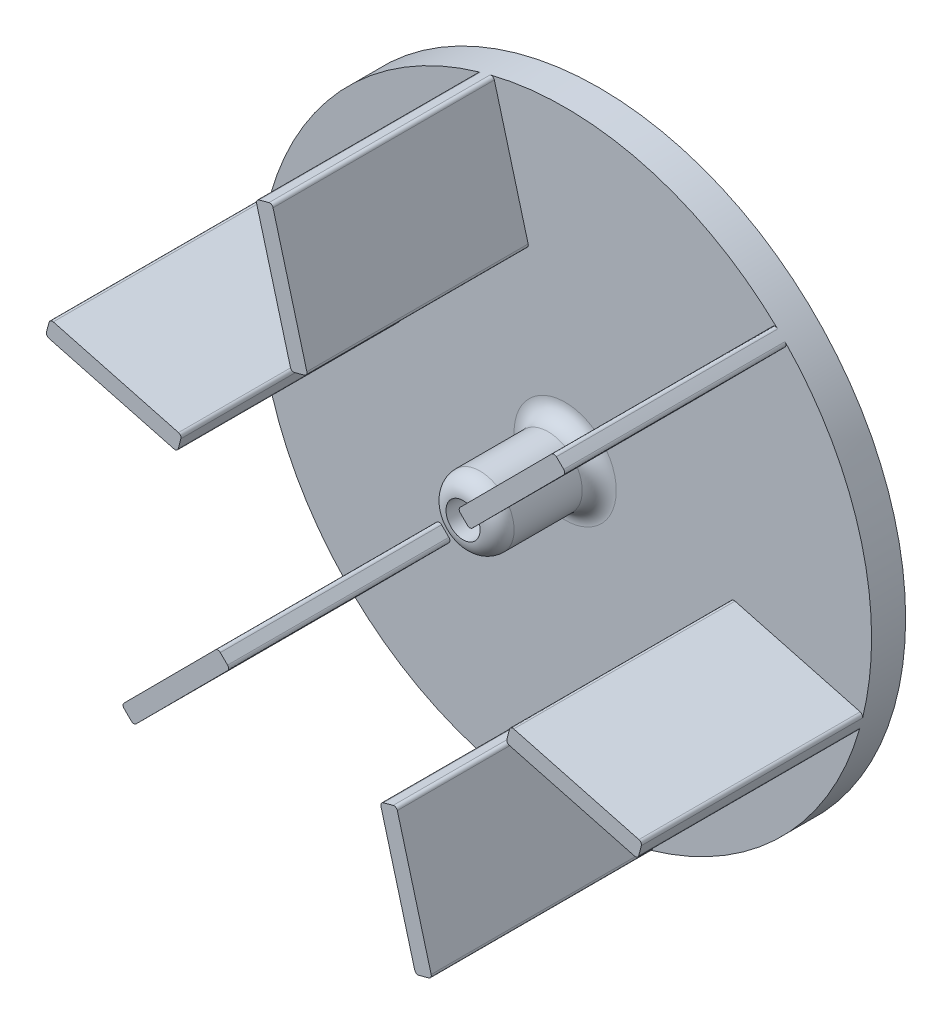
ISO-10303-21;
HEADER;
FILE_DESCRIPTION(('STEP AP214'),'2;1');
FILE_NAME('part.step','',(''),(''),'','','');
FILE_SCHEMA(('AUTOMOTIVE_DESIGN { 1 0 10303 214 1 1 1 1 }'));
ENDSEC;
DATA;
#1=APPLICATION_CONTEXT('core data for automotive mechanical design processes');
#2=APPLICATION_PROTOCOL_DEFINITION('international standard','automotive_design',2000,#1);
#3=PRODUCT_CONTEXT('',#1,'mechanical');
#4=PRODUCT('Part','Part','',(#3));
#5=PRODUCT_RELATED_PRODUCT_CATEGORY('part','',(#4));
#6=PRODUCT_DEFINITION_FORMATION('','',#4);
#7=PRODUCT_DEFINITION_CONTEXT('part definition',#1,'design');
#8=PRODUCT_DEFINITION('design','',#6,#7);
#9=PRODUCT_DEFINITION_SHAPE('','',#8);
#10=(LENGTH_UNIT() NAMED_UNIT(*) SI_UNIT(.MILLI.,.METRE.));
#11=(NAMED_UNIT(*) PLANE_ANGLE_UNIT() SI_UNIT($,.RADIAN.));
#12=(NAMED_UNIT(*) SI_UNIT($,.STERADIAN.) SOLID_ANGLE_UNIT());
#13=UNCERTAINTY_MEASURE_WITH_UNIT(LENGTH_MEASURE(1.E-05),#10,'distance_accuracy_value','');
#14=(GEOMETRIC_REPRESENTATION_CONTEXT(3) GLOBAL_UNCERTAINTY_ASSIGNED_CONTEXT((#13)) GLOBAL_UNIT_ASSIGNED_CONTEXT((#10,
#11,#12)) REPRESENTATION_CONTEXT('',''));
#15=CARTESIAN_POINT('',(0.,0.,0.));
#16=DIRECTION('',(0.,0.,1.));
#17=DIRECTION('',(1.,0.,0.));
#18=AXIS2_PLACEMENT_3D('',#15,#16,#17);
#19=CARTESIAN_POINT('',(0.,0.,0.));
#20=DIRECTION('',(0.,0.,1.));
#21=DIRECTION('',(1.,0.,0.));
#22=AXIS2_PLACEMENT_3D('',#19,#20,#21);
#23=PLANE('',#22);
#24=CARTESIAN_POINT('',(0.,0.,0.));
#25=DIRECTION('',(0.,0.,1.));
#26=DIRECTION('',(1.,0.,0.));
#27=AXIS2_PLACEMENT_3D('',#24,#25,#26);
#28=CIRCLE('',#27,3.);
#29=CARTESIAN_POINT('',(3.,0.,0.));
#30=VERTEX_POINT('',#29);
#31=EDGE_CURVE('E415',#30,#30,#28,.F.);
#32=ORIENTED_EDGE('',*,*,#31,.T.);
#33=EDGE_LOOP('',(#32));
#34=FACE_BOUND('',#33,.T.);
#35=CARTESIAN_POINT('',(0.,0.,0.));
#36=DIRECTION('',(0.,0.,1.));
#37=DIRECTION('',(1.,0.,0.));
#38=AXIS2_PLACEMENT_3D('',#35,#36,#37);
#39=CIRCLE('',#38,18.);
#40=CARTESIAN_POINT('',(12.4831508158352,12.9680740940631,0.));
#41=VERTEX_POINT('',#40);
#42=CARTESIAN_POINT('',(-4.40338510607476,17.4530856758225,0.));
#43=VERTEX_POINT('',#42);
#44=EDGE_CURVE('E59',#41,#43,#39,.T.);
#45=ORIENTED_EDGE('',*,*,#44,.T.);
#46=CARTESIAN_POINT('',(-4.35445860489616,17.2591625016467,0.));
#47=DIRECTION('',(0.,0.,1.));
#48=DIRECTION('',(1.,0.,0.));
#49=AXIS2_PLACEMENT_3D('',#46,#47,#48);
#50=CIRCLE('',#49,0.2);
#51=CARTESIAN_POINT('',(-4.16138757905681,17.3113504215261,0.));
#52=VERTEX_POINT('',#51);
#53=EDGE_CURVE('E52',#43,#52,#50,.F.);
#54=ORIENTED_EDGE('',*,*,#53,.T.);
#55=DIRECTION('',(-0.260939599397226,0.96535512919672,0.));
#56=VECTOR('',#55,1.);
#57=CARTESIAN_POINT('',(-2.12345464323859,9.77194660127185,0.));
#58=LINE('',#57,#56);
#59=CARTESIAN_POINT('',(-2.17564256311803,9.9650176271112,0.));
#60=VERTEX_POINT('',#59);
#61=EDGE_CURVE('E718',#60,#52,#58,.T.);
#62=ORIENTED_EDGE('',*,*,#61,.F.);
#63=CARTESIAN_POINT('',(-2.36871358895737,9.91282970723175,0.));
#64=DIRECTION('',(0.,0.,1.));
#65=DIRECTION('',(1.,0.,0.));
#66=AXIS2_PLACEMENT_3D('',#63,#64,#65);
#67=CIRCLE('',#66,0.2);
#68=CARTESIAN_POINT('',(-2.31652566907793,9.71975868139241,0.));
#69=VERTEX_POINT('',#68);
#70=EDGE_CURVE('E713',#60,#69,#67,.F.);
#71=ORIENTED_EDGE('',*,*,#70,.T.);
#72=DIRECTION('',(0.96535512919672,0.260939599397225,0.));
#73=VECTOR('',#72,1.);
#74=CARTESIAN_POINT('',(-3.0888097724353,9.51100700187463,0.));
#75=LINE('',#74,#73);
#76=CARTESIAN_POINT('',(-2.89573874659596,9.56319492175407,0.));
#77=VERTEX_POINT('',#76);
#78=EDGE_CURVE('E729',#77,#69,#75,.T.);
#79=ORIENTED_EDGE('',*,*,#78,.F.);
#80=CARTESIAN_POINT('',(-2.9479266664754,9.75626594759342,0.));
#81=DIRECTION('',(0.,0.,1.));
#82=DIRECTION('',(1.,0.,0.));
#83=AXIS2_PLACEMENT_3D('',#80,#81,#82);
#84=CIRCLE('',#83,0.2);
#85=CARTESIAN_POINT('',(-3.14099769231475,9.70407802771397,0.));
#86=VERTEX_POINT('',#85);
#87=EDGE_CURVE('E710',#77,#86,#84,.F.);
#88=ORIENTED_EDGE('',*,*,#87,.T.);
#89=DIRECTION('',(0.260939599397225,-0.96535512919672,0.));
#90=VECTOR('',#89,1.);
#91=CARTESIAN_POINT('',(-3.0888097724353,9.51100700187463,0.));
#92=LINE('',#91,#90);
#93=CARTESIAN_POINT('',(-5.12674270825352,17.0504108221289,0.));
#94=VERTEX_POINT('',#93);
#95=EDGE_CURVE('E728',#94,#86,#92,.T.);
#96=ORIENTED_EDGE('',*,*,#95,.F.);
#97=CARTESIAN_POINT('',(-4.93367168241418,17.1025987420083,0.));
#98=DIRECTION('',(0.,0.,1.));
#99=DIRECTION('',(1.,0.,0.));
#100=AXIS2_PLACEMENT_3D('',#97,#98,#99);
#101=CIRCLE('',#100,0.2);
#102=CARTESIAN_POINT('',(-4.98910619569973,17.2947627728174,0.));
#103=VERTEX_POINT('',#102);
#104=EDGE_CURVE('E11',#94,#103,#101,.F.);
#105=ORIENTED_EDGE('',*,*,#104,.T.);
#106=CARTESIAN_POINT('',(-17.3165081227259,4.91309947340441,0.));
#107=VERTEX_POINT('',#106);
#108=EDGE_CURVE('E67',#103,#107,#39,.T.);
#109=ORIENTED_EDGE('',*,*,#108,.T.);
#110=CARTESIAN_POINT('',(-17.1241024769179,4.85850947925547,0.));
#111=DIRECTION('',(0.,0.,1.));
#112=DIRECTION('',(1.,0.,0.));
#113=AXIS2_PLACEMENT_3D('',#110,#111,#112);
#114=CIRCLE('',#113,0.2);
#115=CARTESIAN_POINT('',(-17.0727630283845,5.05180785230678,0.));
#116=VERTEX_POINT('',#115);
#117=EDGE_CURVE('E663',#107,#116,#114,.F.);
#118=ORIENTED_EDGE('',*,*,#117,.T.);
#119=DIRECTION('',(-0.966491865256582,0.256697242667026,0.));
#120=VECTOR('',#119,1.);
#121=CARTESIAN_POINT('',(-9.52448132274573,3.04700763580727,0.));
#122=LINE('',#121,#120);
#123=CARTESIAN_POINT('',(-9.71777969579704,3.09834708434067,0.));
#124=VERTEX_POINT('',#123);
#125=EDGE_CURVE('E781',#124,#116,#122,.T.);
#126=ORIENTED_EDGE('',*,*,#125,.F.);
#127=CARTESIAN_POINT('',(-9.76911914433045,2.90504871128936,0.));
#128=DIRECTION('',(0.,0.,1.));
#129=DIRECTION('',(1.,0.,0.));
#130=AXIS2_PLACEMENT_3D('',#127,#128,#129);
#131=CIRCLE('',#130,0.2);
#132=CARTESIAN_POINT('',(-9.57582077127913,2.85370926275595,0.));
#133=VERTEX_POINT('',#132);
#134=EDGE_CURVE('E660',#124,#133,#131,.F.);
#135=ORIENTED_EDGE('',*,*,#134,.T.);
#136=DIRECTION('',(0.256697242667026,0.966491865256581,0.));
#137=VECTOR('',#136,1.);
#138=CARTESIAN_POINT('',(-9.78117856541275,2.08051577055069,0.));
#139=LINE('',#138,#137);
#140=CARTESIAN_POINT('',(-9.72983911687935,2.273814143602,0.));
#141=VERTEX_POINT('',#140);
#142=EDGE_CURVE('E748',#141,#133,#139,.T.);
#143=ORIENTED_EDGE('',*,*,#142,.F.);
#144=CARTESIAN_POINT('',(-9.92313748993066,2.32515359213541,0.));
#145=DIRECTION('',(0.,0.,1.));
#146=DIRECTION('',(1.,0.,0.));
#147=AXIS2_PLACEMENT_3D('',#144,#145,#146);
#148=CIRCLE('',#147,0.2);
#149=CARTESIAN_POINT('',(-9.97447693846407,2.13185521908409,0.));
#150=VERTEX_POINT('',#149);
#151=EDGE_CURVE('E657',#141,#150,#148,.F.);
#152=ORIENTED_EDGE('',*,*,#151,.T.);
#153=DIRECTION('',(0.966491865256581,-0.256697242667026,0.));
#154=VECTOR('',#153,1.);
#155=CARTESIAN_POINT('',(-9.78117856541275,2.08051577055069,0.));
#156=LINE('',#155,#154);
#157=CARTESIAN_POINT('',(-17.3294602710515,4.08531598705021,0.));
#158=VERTEX_POINT('',#157);
#159=EDGE_CURVE('E765',#158,#150,#156,.T.);
#160=ORIENTED_EDGE('',*,*,#159,.F.);
#161=CARTESIAN_POINT('',(-17.2781208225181,4.27861436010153,0.));
#162=DIRECTION('',(0.,0.,1.));
#163=DIRECTION('',(1.,0.,0.));
#164=AXIS2_PLACEMENT_3D('',#161,#162,#163);
#165=CIRCLE('',#164,0.2);
#166=CARTESIAN_POINT('',(-17.4722570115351,4.32668867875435,0.));
#167=VERTEX_POINT('',#166);
#168=EDGE_CURVE('E666',#158,#167,#165,.F.);
#169=ORIENTED_EDGE('',*,*,#168,.T.);
#170=CARTESIAN_POINT('',(-12.913123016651,-12.5399862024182,0.));
#171=VERTEX_POINT('',#170);
#172=EDGE_CURVE('E1126',#167,#171,#39,.T.);
#173=ORIENTED_EDGE('',*,*,#172,.T.);
#174=CARTESIAN_POINT('',(-12.7696438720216,-12.4006530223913,0.));
#175=DIRECTION('',(0.,0.,1.));
#176=DIRECTION('',(1.,0.,0.));
#177=AXIS2_PLACEMENT_3D('',#174,#175,#176);
#178=CIRCLE('',#177,0.2);
#179=CARTESIAN_POINT('',(-12.9113754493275,-12.2595425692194,0.));
#180=VERTEX_POINT('',#179);
#181=EDGE_CURVE('E611',#171,#180,#178,.F.);
#182=ORIENTED_EDGE('',*,*,#181,.T.);
#183=DIRECTION('',(-0.705552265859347,-0.7086578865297,0.));
#184=VECTOR('',#183,1.);
#185=CARTESIAN_POINT('',(-7.40102667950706,-6.72493896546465,0.));
#186=LINE('',#185,#184);
#187=CARTESIAN_POINT('',(-7.54213713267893,-6.86667054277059,0.));
#188=VERTEX_POINT('',#187);
#189=EDGE_CURVE('E809',#188,#180,#186,.T.);
#190=ORIENTED_EDGE('',*,*,#189,.F.);
#191=CARTESIAN_POINT('',(-7.40040555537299,-7.00778099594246,0.));
#192=DIRECTION('',(0.,0.,1.));
#193=DIRECTION('',(1.,0.,0.));
#194=AXIS2_PLACEMENT_3D('',#191,#192,#193);
#195=CIRCLE('',#194,0.2);
#196=CARTESIAN_POINT('',(-7.25929510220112,-6.86604941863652,0.));
#197=VERTEX_POINT('',#196);
#198=EDGE_CURVE('E608',#188,#197,#195,.F.);
#199=ORIENTED_EDGE('',*,*,#198,.T.);
#200=DIRECTION('',(-0.7086578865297,0.705552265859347,0.));
#201=VECTOR('',#200,1.);
#202=CARTESIAN_POINT('',(-6.69236879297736,-7.430491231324,0.));
#203=LINE('',#202,#201);
#204=CARTESIAN_POINT('',(-6.8341003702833,-7.28938077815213,0.));
#205=VERTEX_POINT('',#204);
#206=EDGE_CURVE('E777',#205,#197,#203,.T.);
#207=ORIENTED_EDGE('',*,*,#206,.F.);
#208=CARTESIAN_POINT('',(-6.97521082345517,-7.43111235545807,0.));
#209=DIRECTION('',(0.,0.,1.));
#210=DIRECTION('',(1.,0.,0.));
#211=AXIS2_PLACEMENT_3D('',#208,#209,#210);
#212=CIRCLE('',#211,0.2);
#213=CARTESIAN_POINT('',(-6.83347924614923,-7.57222280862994,0.));
#214=VERTEX_POINT('',#213);
#215=EDGE_CURVE('E605',#205,#214,#212,.F.);
#216=ORIENTED_EDGE('',*,*,#215,.T.);
#217=DIRECTION('',(0.705552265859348,0.7086578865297,0.));
#218=VECTOR('',#217,1.);
#219=CARTESIAN_POINT('',(-6.69236879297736,-7.430491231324,0.));
#220=LINE('',#219,#218);
#221=CARTESIAN_POINT('',(-12.2027175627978,-12.9650948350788,0.));
#222=VERTEX_POINT('',#221);
#223=EDGE_CURVE('E793',#222,#214,#220,.T.);
#224=ORIENTED_EDGE('',*,*,#223,.F.);
#225=CARTESIAN_POINT('',(-12.3444491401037,-12.8239843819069,0.));
#226=DIRECTION('',(0.,0.,1.));
#227=DIRECTION('',(1.,0.,0.));
#228=AXIS2_PLACEMENT_3D('',#225,#226,#227);
#229=CIRCLE('',#228,0.2);
#230=CARTESIAN_POINT('',(-12.4831508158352,-12.9680740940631,0.));
#231=VERTEX_POINT('',#230);
#232=EDGE_CURVE('E614',#222,#231,#229,.F.);
#233=ORIENTED_EDGE('',*,*,#232,.T.);
#234=CARTESIAN_POINT('',(4.40338510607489,-17.4530856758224,0.));
#235=VERTEX_POINT('',#234);
#236=EDGE_CURVE('E1148',#231,#235,#39,.T.);
#237=ORIENTED_EDGE('',*,*,#236,.T.);
#238=CARTESIAN_POINT('',(4.35445860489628,-17.2591625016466,0.));
#239=DIRECTION('',(0.,0.,1.));
#240=DIRECTION('',(1.,0.,0.));
#241=AXIS2_PLACEMENT_3D('',#238,#239,#240);
#242=CIRCLE('',#241,0.2);
#243=CARTESIAN_POINT('',(4.16138757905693,-17.3113504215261,0.));
#244=VERTEX_POINT('',#243);
#245=EDGE_CURVE('E558',#235,#244,#242,.F.);
#246=ORIENTED_EDGE('',*,*,#245,.T.);
#247=DIRECTION('',(0.260939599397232,-0.965355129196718,0.));
#248=VECTOR('',#247,1.);
#249=CARTESIAN_POINT('',(2.12345464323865,-9.77194660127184,0.));
#250=LINE('',#249,#248);
#251=CARTESIAN_POINT('',(2.1756425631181,-9.96501762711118,0.));
#252=VERTEX_POINT('',#251);
#253=EDGE_CURVE('E837',#252,#244,#250,.T.);
#254=ORIENTED_EDGE('',*,*,#253,.F.);
#255=CARTESIAN_POINT('',(2.36871358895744,-9.91282970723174,0.));
#256=DIRECTION('',(0.,0.,1.));
#257=DIRECTION('',(1.,0.,0.));
#258=AXIS2_PLACEMENT_3D('',#255,#256,#257);
#259=CIRCLE('',#258,0.2);
#260=CARTESIAN_POINT('',(2.316525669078,-9.71975868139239,0.));
#261=VERTEX_POINT('',#260);
#262=EDGE_CURVE('E555',#252,#261,#259,.F.);
#263=ORIENTED_EDGE('',*,*,#262,.T.);
#264=DIRECTION('',(-0.965355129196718,-0.260939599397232,0.));
#265=VECTOR('',#264,1.);
#266=CARTESIAN_POINT('',(3.08880977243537,-9.51100700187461,0.));
#267=LINE('',#266,#265);
#268=CARTESIAN_POINT('',(2.89573874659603,-9.56319492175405,0.));
#269=VERTEX_POINT('',#268);
#270=EDGE_CURVE('E805',#269,#261,#267,.T.);
#271=ORIENTED_EDGE('',*,*,#270,.F.);
#272=CARTESIAN_POINT('',(2.94792666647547,-9.7562659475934,0.));
#273=DIRECTION('',(0.,0.,1.));
#274=DIRECTION('',(1.,0.,0.));
#275=AXIS2_PLACEMENT_3D('',#272,#273,#274);
#276=CIRCLE('',#275,0.2);
#277=CARTESIAN_POINT('',(3.14099769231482,-9.70407802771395,0.));
#278=VERTEX_POINT('',#277);
#279=EDGE_CURVE('E552',#269,#278,#276,.F.);
#280=ORIENTED_EDGE('',*,*,#279,.T.);
#281=DIRECTION('',(-0.260939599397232,0.965355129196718,0.));
#282=VECTOR('',#281,1.);
#283=CARTESIAN_POINT('',(3.08880977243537,-9.51100700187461,0.));
#284=LINE('',#283,#282);
#285=CARTESIAN_POINT('',(5.12674270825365,-17.0504108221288,0.));
#286=VERTEX_POINT('',#285);
#287=EDGE_CURVE('E821',#286,#278,#284,.T.);
#288=ORIENTED_EDGE('',*,*,#287,.F.);
#289=CARTESIAN_POINT('',(4.9336716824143,-17.1025987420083,0.));
#290=DIRECTION('',(0.,0.,1.));
#291=DIRECTION('',(1.,0.,0.));
#292=AXIS2_PLACEMENT_3D('',#289,#290,#291);
#293=CIRCLE('',#292,0.2);
#294=CARTESIAN_POINT('',(4.98910619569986,-17.2947627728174,0.));
#295=VERTEX_POINT('',#294);
#296=EDGE_CURVE('E561',#286,#295,#293,.F.);
#297=ORIENTED_EDGE('',*,*,#296,.T.);
#298=CARTESIAN_POINT('',(17.316508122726,-4.91309947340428,0.));
#299=VERTEX_POINT('',#298);
#300=EDGE_CURVE('E1170',#295,#299,#39,.T.);
#301=ORIENTED_EDGE('',*,*,#300,.T.);
#302=CARTESIAN_POINT('',(17.1241024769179,-4.85850947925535,0.));
#303=DIRECTION('',(0.,0.,1.));
#304=DIRECTION('',(1.,0.,0.));
#305=AXIS2_PLACEMENT_3D('',#302,#303,#304);
#306=CIRCLE('',#305,0.2);
#307=CARTESIAN_POINT('',(17.0727630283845,-5.05180785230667,0.));
#308=VERTEX_POINT('',#307);
#309=EDGE_CURVE('E505',#299,#308,#306,.F.);
#310=ORIENTED_EDGE('',*,*,#309,.T.);
#311=DIRECTION('',(0.966491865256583,-0.256697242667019,0.));
#312=VECTOR('',#311,1.);
#313=CARTESIAN_POINT('',(9.52448132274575,-3.0470076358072,0.));
#314=LINE('',#313,#312);
#315=CARTESIAN_POINT('',(9.71777969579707,-3.0983470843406,0.));
#316=VERTEX_POINT('',#315);
#317=EDGE_CURVE('E859',#316,#308,#314,.T.);
#318=ORIENTED_EDGE('',*,*,#317,.F.);
#319=CARTESIAN_POINT('',(9.76911914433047,-2.90504871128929,0.));
#320=DIRECTION('',(0.,0.,1.));
#321=DIRECTION('',(1.,0.,0.));
#322=AXIS2_PLACEMENT_3D('',#319,#320,#321);
#323=CIRCLE('',#322,0.2);
#324=CARTESIAN_POINT('',(9.57582077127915,-2.85370926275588,0.));
#325=VERTEX_POINT('',#324);
#326=EDGE_CURVE('E502',#316,#325,#323,.F.);
#327=ORIENTED_EDGE('',*,*,#326,.T.);
#328=DIRECTION('',(-0.256697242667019,-0.966491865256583,0.));
#329=VECTOR('',#328,1.);
#330=CARTESIAN_POINT('',(9.78117856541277,-2.08051577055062,0.));
#331=LINE('',#330,#329);
#332=CARTESIAN_POINT('',(9.72983911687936,-2.27381414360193,0.));
#333=VERTEX_POINT('',#332);
#334=EDGE_CURVE('E833',#333,#325,#331,.T.);
#335=ORIENTED_EDGE('',*,*,#334,.F.);
#336=CARTESIAN_POINT('',(9.92313748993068,-2.32515359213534,0.));
#337=DIRECTION('',(0.,0.,1.));
#338=DIRECTION('',(1.,0.,0.));
#339=AXIS2_PLACEMENT_3D('',#336,#337,#338);
#340=CIRCLE('',#339,0.2);
#341=CARTESIAN_POINT('',(9.97447693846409,-2.13185521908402,0.));
#342=VERTEX_POINT('',#341);
#343=EDGE_CURVE('E499',#333,#342,#340,.F.);
#344=ORIENTED_EDGE('',*,*,#343,.T.);
#345=DIRECTION('',(-0.966491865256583,0.25669724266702,0.));
#346=VECTOR('',#345,1.);
#347=CARTESIAN_POINT('',(9.78117856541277,-2.08051577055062,0.));
#348=LINE('',#347,#346);
#349=CARTESIAN_POINT('',(17.3294602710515,-4.08531598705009,0.));
#350=VERTEX_POINT('',#349);
#351=EDGE_CURVE('E849',#350,#342,#348,.T.);
#352=ORIENTED_EDGE('',*,*,#351,.F.);
#353=CARTESIAN_POINT('',(17.2781208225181,-4.27861436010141,0.));
#354=DIRECTION('',(0.,0.,1.));
#355=DIRECTION('',(1.,0.,0.));
#356=AXIS2_PLACEMENT_3D('',#353,#354,#355);
#357=CIRCLE('',#356,0.2);
#358=CARTESIAN_POINT('',(17.4722570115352,-4.32668867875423,0.));
#359=VERTEX_POINT('',#358);
#360=EDGE_CURVE('E508',#350,#359,#357,.F.);
#361=ORIENTED_EDGE('',*,*,#360,.T.);
#362=CARTESIAN_POINT('',(12.913123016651,12.5399862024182,0.));
#363=VERTEX_POINT('',#362);
#364=EDGE_CURVE('E400',#359,#363,#39,.T.);
#365=ORIENTED_EDGE('',*,*,#364,.T.);
#366=CARTESIAN_POINT('',(12.7696438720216,12.4006530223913,0.));
#367=DIRECTION('',(0.,0.,1.));
#368=DIRECTION('',(1.,0.,0.));
#369=AXIS2_PLACEMENT_3D('',#366,#367,#368);
#370=CIRCLE('',#369,0.2);
#371=CARTESIAN_POINT('',(12.9113754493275,12.2595425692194,0.));
#372=VERTEX_POINT('',#371);
#373=EDGE_CURVE('E453',#363,#372,#370,.F.);
#374=ORIENTED_EDGE('',*,*,#373,.T.);
#375=DIRECTION('',(0.705552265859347,0.7086578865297,0.));
#376=VECTOR('',#375,1.);
#377=CARTESIAN_POINT('',(7.40102667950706,6.72493896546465,0.));
#378=LINE('',#377,#376);
#379=CARTESIAN_POINT('',(7.54213713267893,6.86667054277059,0.));
#380=VERTEX_POINT('',#379);
#381=EDGE_CURVE('E375',#380,#372,#378,.T.);
#382=ORIENTED_EDGE('',*,*,#381,.F.);
#383=CARTESIAN_POINT('',(7.40040555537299,7.00778099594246,0.));
#384=DIRECTION('',(0.,0.,1.));
#385=DIRECTION('',(1.,0.,0.));
#386=AXIS2_PLACEMENT_3D('',#383,#384,#385);
#387=CIRCLE('',#386,0.2);
#388=CARTESIAN_POINT('',(7.25929510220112,6.86604941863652,0.));
#389=VERTEX_POINT('',#388);
#390=EDGE_CURVE('E358',#380,#389,#387,.F.);
#391=ORIENTED_EDGE('',*,*,#390,.T.);
#392=DIRECTION('',(0.7086578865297,-0.705552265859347,0.));
#393=VECTOR('',#392,1.);
#394=CARTESIAN_POINT('',(6.69236879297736,7.430491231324,0.));
#395=LINE('',#394,#393);
#396=CARTESIAN_POINT('',(6.8341003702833,7.28938077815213,0.));
#397=VERTEX_POINT('',#396);
#398=EDGE_CURVE('E365',#397,#389,#395,.T.);
#399=ORIENTED_EDGE('',*,*,#398,.F.);
#400=CARTESIAN_POINT('',(6.97521082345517,7.43111235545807,0.));
#401=DIRECTION('',(0.,0.,1.));
#402=DIRECTION('',(1.,0.,0.));
#403=AXIS2_PLACEMENT_3D('',#400,#401,#402);
#404=CIRCLE('',#403,0.2);
#405=CARTESIAN_POINT('',(6.83347924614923,7.57222280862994,0.));
#406=VERTEX_POINT('',#405);
#407=EDGE_CURVE('E348',#397,#406,#404,.F.);
#408=ORIENTED_EDGE('',*,*,#407,.T.);
#409=DIRECTION('',(-0.705552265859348,-0.7086578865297,0.));
#410=VECTOR('',#409,1.);
#411=CARTESIAN_POINT('',(6.69236879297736,7.430491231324,0.));
#412=LINE('',#411,#410);
#413=CARTESIAN_POINT('',(12.2027175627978,12.9650948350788,0.));
#414=VERTEX_POINT('',#413);
#415=EDGE_CURVE('E381',#414,#406,#412,.T.);
#416=ORIENTED_EDGE('',*,*,#415,.F.);
#417=CARTESIAN_POINT('',(12.3444491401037,12.8239843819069,0.));
#418=DIRECTION('',(0.,0.,1.));
#419=DIRECTION('',(1.,0.,0.));
#420=AXIS2_PLACEMENT_3D('',#417,#418,#419);
#421=CIRCLE('',#420,0.2);
#422=EDGE_CURVE('E456',#414,#41,#421,.F.);
#423=ORIENTED_EDGE('',*,*,#422,.T.);
#424=EDGE_LOOP('',(#45,#54,#62,#71,#79,#88,#96,#105,#109,#118,#126,#135,#143,#152,#160,#169,
#173,#182,#190,#199,#207,#216,#224,#233,#237,#246,#254,#263,#271,#280,#288,#297,#301,#310,#318,
#327,#335,#344,#352,#361,#365,#374,#382,#391,#399,#408,#416,#423));
#425=FACE_BOUND('',#424,.T.);
#426=ADVANCED_FACE('F43',(#34,#425),#23,.T.);
#427=CARTESIAN_POINT('',(0.,0.,-2.));
#428=DIRECTION('',(0.,0.,1.));
#429=DIRECTION('',(1.,0.,0.));
#430=AXIS2_PLACEMENT_3D('',#427,#428,#429);
#431=CYLINDRICAL_SURFACE('',#430,18.);
#432=CARTESIAN_POINT('',(0.,0.,-2.));
#433=DIRECTION('',(0.,0.,1.));
#434=DIRECTION('',(1.,0.,0.));
#435=AXIS2_PLACEMENT_3D('',#432,#433,#434);
#436=CIRCLE('',#435,18.);
#437=CARTESIAN_POINT('',(18.,0.,-2.));
#438=VERTEX_POINT('',#437);
#439=EDGE_CURVE('E401',#438,#438,#436,.T.);
#440=ORIENTED_EDGE('',*,*,#439,.T.);
#441=EDGE_LOOP('',(#440));
#442=FACE_BOUND('',#441,.T.);
#443=CARTESIAN_POINT('',(0.,0.,13.));
#444=DIRECTION('',(0.,0.,1.));
#445=DIRECTION('',(0.50000000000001,0.866025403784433,0.));
#446=AXIS2_PLACEMENT_3D('',#443,#444,#445);
#447=CIRCLE('',#446,18.);
#448=CARTESIAN_POINT('',(-4.40338510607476,17.4530856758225,13.));
#449=VERTEX_POINT('',#448);
#450=CARTESIAN_POINT('',(-4.98910619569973,17.2947627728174,13.));
#451=VERTEX_POINT('',#450);
#452=EDGE_CURVE('E738',#449,#451,#447,.T.);
#453=ORIENTED_EDGE('',*,*,#452,.F.);
#454=DIRECTION('',(0.,0.,1.));
#455=VECTOR('',#454,1.);
#456=CARTESIAN_POINT('',(-4.40338510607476,17.4530856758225,-2.));
#457=LINE('',#456,#455);
#458=EDGE_CURVE('E706',#449,#43,#457,.F.);
#459=ORIENTED_EDGE('',*,*,#458,.T.);
#460=ORIENTED_EDGE('',*,*,#44,.F.);
#461=DIRECTION('',(0.,0.,1.));
#462=VECTOR('',#461,1.);
#463=CARTESIAN_POINT('',(12.4831508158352,12.9680740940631,-2.));
#464=LINE('',#463,#462);
#465=CARTESIAN_POINT('',(12.4831508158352,12.9680740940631,13.));
#466=VERTEX_POINT('',#465);
#467=EDGE_CURVE('E445',#41,#466,#464,.T.);
#468=ORIENTED_EDGE('',*,*,#467,.T.);
#469=CARTESIAN_POINT('',(0.,0.,13.));
#470=DIRECTION('',(0.,0.,1.));
#471=DIRECTION('',(1.,0.,0.));
#472=AXIS2_PLACEMENT_3D('',#469,#470,#471);
#473=CIRCLE('',#472,18.);
#474=CARTESIAN_POINT('',(12.913123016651,12.5399862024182,13.));
#475=VERTEX_POINT('',#474);
#476=EDGE_CURVE('E871',#475,#466,#473,.T.);
#477=ORIENTED_EDGE('',*,*,#476,.F.);
#478=DIRECTION('',(0.,0.,1.));
#479=VECTOR('',#478,1.);
#480=CARTESIAN_POINT('',(12.913123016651,12.5399862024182,-2.));
#481=LINE('',#480,#479);
#482=EDGE_CURVE('E359',#475,#363,#481,.F.);
#483=ORIENTED_EDGE('',*,*,#482,.T.);
#484=ORIENTED_EDGE('',*,*,#364,.F.);
#485=DIRECTION('',(0.,0.,1.));
#486=VECTOR('',#485,1.);
#487=CARTESIAN_POINT('',(17.4722570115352,-4.32668867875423,-2.));
#488=LINE('',#487,#486);
#489=CARTESIAN_POINT('',(17.4722570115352,-4.32668867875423,13.));
#490=VERTEX_POINT('',#489);
#491=EDGE_CURVE('E492',#359,#490,#488,.T.);
#492=ORIENTED_EDGE('',*,*,#491,.T.);
#493=CARTESIAN_POINT('',(0.,0.,13.));
#494=DIRECTION('',(0.,0.,1.));
#495=DIRECTION('',(0.499999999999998,-0.86602540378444,0.));
#496=AXIS2_PLACEMENT_3D('',#493,#494,#495);
#497=CIRCLE('',#496,18.);
#498=CARTESIAN_POINT('',(17.316508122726,-4.91309947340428,13.));
#499=VERTEX_POINT('',#498);
#500=EDGE_CURVE('E384',#499,#490,#497,.T.);
#501=ORIENTED_EDGE('',*,*,#500,.F.);
#502=DIRECTION('',(0.,0.,1.));
#503=VECTOR('',#502,1.);
#504=CARTESIAN_POINT('',(17.316508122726,-4.91309947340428,-2.));
#505=LINE('',#504,#503);
#506=EDGE_CURVE('E495',#499,#299,#505,.F.);
#507=ORIENTED_EDGE('',*,*,#506,.T.);
#508=ORIENTED_EDGE('',*,*,#300,.F.);
#509=DIRECTION('',(0.,0.,1.));
#510=VECTOR('',#509,1.);
#511=CARTESIAN_POINT('',(4.98910619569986,-17.2947627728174,-2.));
#512=LINE('',#511,#510);
#513=CARTESIAN_POINT('',(4.98910619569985,-17.2947627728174,13.));
#514=VERTEX_POINT('',#513);
#515=EDGE_CURVE('E545',#295,#514,#512,.T.);
#516=ORIENTED_EDGE('',*,*,#515,.T.);
#517=CARTESIAN_POINT('',(0.,0.,13.));
#518=DIRECTION('',(0.,0.,1.));
#519=DIRECTION('',(-0.500000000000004,-0.866025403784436,0.));
#520=AXIS2_PLACEMENT_3D('',#517,#518,#519);
#521=CIRCLE('',#520,18.);
#522=CARTESIAN_POINT('',(4.40338510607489,-17.4530856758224,13.));
#523=VERTEX_POINT('',#522);
#524=EDGE_CURVE('E825',#523,#514,#521,.T.);
#525=ORIENTED_EDGE('',*,*,#524,.F.);
#526=DIRECTION('',(0.,0.,1.));
#527=VECTOR('',#526,1.);
#528=CARTESIAN_POINT('',(4.40338510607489,-17.4530856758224,-2.));
#529=LINE('',#528,#527);
#530=EDGE_CURVE('E548',#523,#235,#529,.F.);
#531=ORIENTED_EDGE('',*,*,#530,.T.);
#532=ORIENTED_EDGE('',*,*,#236,.F.);
#533=DIRECTION('',(0.,0.,1.));
#534=VECTOR('',#533,1.);
#535=CARTESIAN_POINT('',(-12.4831508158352,-12.9680740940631,-2.));
#536=LINE('',#535,#534);
#537=CARTESIAN_POINT('',(-12.4831508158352,-12.9680740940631,13.));
#538=VERTEX_POINT('',#537);
#539=EDGE_CURVE('E598',#231,#538,#536,.T.);
#540=ORIENTED_EDGE('',*,*,#539,.T.);
#541=CARTESIAN_POINT('',(0.,0.,13.));
#542=DIRECTION('',(0.,0.,1.));
#543=DIRECTION('',(-1.,0.,0.));
#544=AXIS2_PLACEMENT_3D('',#541,#542,#543);
#545=CIRCLE('',#544,18.);
#546=CARTESIAN_POINT('',(-12.913123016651,-12.5399862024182,13.));
#547=VERTEX_POINT('',#546);
#548=EDGE_CURVE('E797',#547,#538,#545,.T.);
#549=ORIENTED_EDGE('',*,*,#548,.F.);
#550=DIRECTION('',(0.,0.,1.));
#551=VECTOR('',#550,1.);
#552=CARTESIAN_POINT('',(-12.913123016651,-12.5399862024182,-2.));
#553=LINE('',#552,#551);
#554=EDGE_CURVE('E601',#547,#171,#553,.F.);
#555=ORIENTED_EDGE('',*,*,#554,.T.);
#556=ORIENTED_EDGE('',*,*,#172,.F.);
#557=DIRECTION('',(0.,0.,1.));
#558=VECTOR('',#557,1.);
#559=CARTESIAN_POINT('',(-17.4722570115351,4.32668867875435,-2.));
#560=LINE('',#559,#558);
#561=CARTESIAN_POINT('',(-17.4722570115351,4.32668867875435,13.));
#562=VERTEX_POINT('',#561);
#563=EDGE_CURVE('E651',#167,#562,#560,.T.);
#564=ORIENTED_EDGE('',*,*,#563,.T.);
#565=CARTESIAN_POINT('',(0.,0.,13.));
#566=DIRECTION('',(0.,0.,1.));
#567=DIRECTION('',(-0.499999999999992,0.866025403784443,0.));
#568=AXIS2_PLACEMENT_3D('',#565,#566,#567);
#569=CIRCLE('',#568,18.);
#570=CARTESIAN_POINT('',(-17.3165081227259,4.91309947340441,13.));
#571=VERTEX_POINT('',#570);
#572=EDGE_CURVE('E769',#571,#562,#569,.T.);
#573=ORIENTED_EDGE('',*,*,#572,.F.);
#574=DIRECTION('',(0.,0.,1.));
#575=VECTOR('',#574,1.);
#576=CARTESIAN_POINT('',(-17.3165081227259,4.91309947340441,-2.));
#577=LINE('',#576,#575);
#578=EDGE_CURVE('E654',#571,#107,#577,.F.);
#579=ORIENTED_EDGE('',*,*,#578,.T.);
#580=ORIENTED_EDGE('',*,*,#108,.F.);
#581=DIRECTION('',(0.,0.,1.));
#582=VECTOR('',#581,1.);
#583=CARTESIAN_POINT('',(-4.98910619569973,17.2947627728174,-2.));
#584=LINE('',#583,#582);
#585=EDGE_CURVE('E703',#103,#451,#584,.T.);
#586=ORIENTED_EDGE('',*,*,#585,.T.);
#587=EDGE_LOOP('',(#453,#459,#460,#468,#477,#483,#484,#492,#501,#507,#508,#516,#525,#531,#532,
#540,#549,#555,#556,#564,#573,#579,#580,#586));
#588=FACE_BOUND('',#587,.T.);
#589=ADVANCED_FACE('F741',(#442,#588),#431,.T.);
#590=CARTESIAN_POINT('',(0.,0.,-2.));
#591=DIRECTION('',(0.,0.,1.));
#592=DIRECTION('',(1.,0.,0.));
#593=AXIS2_PLACEMENT_3D('',#590,#591,#592);
#594=PLANE('',#593);
#595=CARTESIAN_POINT('',(0.,0.,-2.));
#596=DIRECTION('',(0.,0.,1.));
#597=DIRECTION('',(1.,0.,0.));
#598=AXIS2_PLACEMENT_3D('',#595,#596,#597);
#599=CIRCLE('',#598,1.);
#600=CARTESIAN_POINT('',(1.,0.,-2.));
#601=VERTEX_POINT('',#600);
#602=EDGE_CURVE('E396',#601,#601,#599,.T.);
#603=ORIENTED_EDGE('',*,*,#602,.T.);
#604=EDGE_LOOP('',(#603));
#605=FACE_BOUND('',#604,.T.);
#606=ORIENTED_EDGE('',*,*,#439,.F.);
#607=EDGE_LOOP('',(#606));
#608=FACE_BOUND('',#607,.T.);
#609=ADVANCED_FACE('F914',(#605,#608),#594,.F.);
#610=CARTESIAN_POINT('',(0.,0.,-2.));
#611=DIRECTION('',(0.,0.,1.));
#612=DIRECTION('',(1.,0.,0.));
#613=AXIS2_PLACEMENT_3D('',#610,#611,#612);
#614=CYLINDRICAL_SURFACE('',#613,1.);
#615=ORIENTED_EDGE('',*,*,#602,.F.);
#616=EDGE_LOOP('',(#615));
#617=FACE_BOUND('',#616,.T.);
#618=CARTESIAN_POINT('',(0.,0.,6.));
#619=DIRECTION('',(0.,0.,1.));
#620=DIRECTION('',(1.,0.,0.));
#621=AXIS2_PLACEMENT_3D('',#618,#619,#620);
#622=CIRCLE('',#621,1.);
#623=CARTESIAN_POINT('',(1.,0.,6.));
#624=VERTEX_POINT('',#623);
#625=EDGE_CURVE('E392',#624,#624,#622,.T.);
#626=ORIENTED_EDGE('',*,*,#625,.T.);
#627=EDGE_LOOP('',(#626));
#628=FACE_BOUND('',#627,.T.);
#629=ADVANCED_FACE('F937',(#617,#628),#614,.F.);
#630=CARTESIAN_POINT('',(0.,0.,6.));
#631=DIRECTION('',(0.,0.,-1.));
#632=DIRECTION('',(-1.,0.,0.));
#633=AXIS2_PLACEMENT_3D('',#630,#631,#632);
#634=CYLINDRICAL_SURFACE('',#633,2.);
#635=CARTESIAN_POINT('',(0.,0.,5.));
#636=DIRECTION('',(0.,0.,1.));
#637=DIRECTION('',(1.,0.,0.));
#638=AXIS2_PLACEMENT_3D('',#635,#636,#637);
#639=CIRCLE('',#638,2.);
#640=CARTESIAN_POINT('',(2.,0.,5.));
#641=VERTEX_POINT('',#640);
#642=EDGE_CURVE('E411',#641,#641,#639,.F.);
#643=ORIENTED_EDGE('',*,*,#642,.T.);
#644=EDGE_LOOP('',(#643));
#645=FACE_BOUND('',#644,.T.);
#646=CARTESIAN_POINT('',(0.,0.,1.));
#647=DIRECTION('',(0.,0.,1.));
#648=DIRECTION('',(1.,0.,0.));
#649=AXIS2_PLACEMENT_3D('',#646,#647,#648);
#650=CIRCLE('',#649,2.);
#651=CARTESIAN_POINT('',(2.,0.,1.));
#652=VERTEX_POINT('',#651);
#653=EDGE_CURVE('E405',#652,#652,#650,.T.);
#654=ORIENTED_EDGE('',*,*,#653,.T.);
#655=EDGE_LOOP('',(#654));
#656=FACE_BOUND('',#655,.T.);
#657=ADVANCED_FACE('F924',(#645,#656),#634,.T.);
#658=CARTESIAN_POINT('',(0.,0.,5.));
#659=DIRECTION('',(0.,0.,1.));
#660=DIRECTION('',(1.,0.,0.));
#661=AXIS2_PLACEMENT_3D('',#658,#659,#660);
#662=DEGENERATE_TOROIDAL_SURFACE('',#661,1.,1.,.T.);
#663=ORIENTED_EDGE('',*,*,#642,.F.);
#664=EDGE_LOOP('',(#663));
#665=FACE_BOUND('',#664,.T.);
#666=ORIENTED_EDGE('',*,*,#625,.F.);
#667=EDGE_LOOP('',(#666));
#668=FACE_BOUND('',#667,.T.);
#669=ADVANCED_FACE('F920',(#665,#668),#662,.T.);
#670=CARTESIAN_POINT('',(0.,0.,1.));
#671=DIRECTION('',(0.,0.,1.));
#672=DIRECTION('',(1.,0.,0.));
#673=AXIS2_PLACEMENT_3D('',#670,#671,#672);
#674=TOROIDAL_SURFACE('',#673,3.,1.);
#675=ORIENTED_EDGE('',*,*,#31,.F.);
#676=EDGE_LOOP('',(#675));
#677=FACE_BOUND('',#676,.T.);
#678=ORIENTED_EDGE('',*,*,#653,.F.);
#679=EDGE_LOOP('',(#678));
#680=FACE_BOUND('',#679,.T.);
#681=ADVANCED_FACE('F923',(#677,#680),#674,.F.);
#682=CARTESIAN_POINT('',(6.69236879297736,7.430491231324,13.));
#683=DIRECTION('',(0.705552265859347,0.7086578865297,0.));
#684=DIRECTION('',(-0.7086578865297,0.705552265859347,0.));
#685=AXIS2_PLACEMENT_3D('',#682,#683,#684);
#686=PLANE('',#685);
#687=DIRECTION('',(0.7086578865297,-0.705552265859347,0.));
#688=VECTOR('',#687,1.);
#689=CARTESIAN_POINT('',(6.69236879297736,7.430491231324,13.));
#690=LINE('',#689,#688);
#691=CARTESIAN_POINT('',(6.8341003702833,7.28938077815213,13.));
#692=VERTEX_POINT('',#691);
#693=CARTESIAN_POINT('',(7.25929510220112,6.86604941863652,13.));
#694=VERTEX_POINT('',#693);
#695=EDGE_CURVE('E368',#692,#694,#690,.T.);
#696=ORIENTED_EDGE('',*,*,#695,.F.);
#697=DIRECTION('',(0.,0.,-1.));
#698=VECTOR('',#697,1.);
#699=CARTESIAN_POINT('',(6.8341003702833,7.28938077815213,13.));
#700=LINE('',#699,#698);
#701=EDGE_CURVE('E352',#692,#397,#700,.T.);
#702=ORIENTED_EDGE('',*,*,#701,.T.);
#703=ORIENTED_EDGE('',*,*,#398,.T.);
#704=DIRECTION('',(0.,0.,-1.));
#705=VECTOR('',#704,1.);
#706=CARTESIAN_POINT('',(7.25929510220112,6.86604941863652,13.));
#707=LINE('',#706,#705);
#708=EDGE_CURVE('E371',#389,#694,#707,.F.);
#709=ORIENTED_EDGE('',*,*,#708,.T.);
#710=EDGE_LOOP('',(#696,#702,#703,#709));
#711=FACE_BOUND('',#710,.T.);
#712=ADVANCED_FACE('F364',(#711),#686,.F.);
#713=CARTESIAN_POINT('',(7.40102667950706,6.72493896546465,13.));
#714=DIRECTION('',(-0.7086578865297,0.705552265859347,0.));
#715=DIRECTION('',(-0.705552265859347,-0.7086578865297,0.));
#716=AXIS2_PLACEMENT_3D('',#713,#714,#715);
#717=PLANE('',#716);
#718=DIRECTION('',(0.705552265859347,0.7086578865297,0.));
#719=VECTOR('',#718,1.);
#720=CARTESIAN_POINT('',(7.40102667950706,6.72493896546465,13.));
#721=LINE('',#720,#719);
#722=CARTESIAN_POINT('',(7.54213713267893,6.86667054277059,13.));
#723=VERTEX_POINT('',#722);
#724=CARTESIAN_POINT('',(12.9113754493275,12.2595425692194,13.));
#725=VERTEX_POINT('',#724);
#726=EDGE_CURVE('E868',#723,#725,#721,.T.);
#727=ORIENTED_EDGE('',*,*,#726,.F.);
#728=DIRECTION('',(0.,0.,-1.));
#729=VECTOR('',#728,1.);
#730=CARTESIAN_POINT('',(7.54213713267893,6.86667054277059,13.));
#731=LINE('',#730,#729);
#732=EDGE_CURVE('E441',#723,#380,#731,.T.);
#733=ORIENTED_EDGE('',*,*,#732,.T.);
#734=ORIENTED_EDGE('',*,*,#381,.T.);
#735=DIRECTION('',(0.,0.,-1.));
#736=VECTOR('',#735,1.);
#737=CARTESIAN_POINT('',(12.9113754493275,12.2595425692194,13.));
#738=LINE('',#737,#736);
#739=EDGE_CURVE('E438',#372,#725,#738,.F.);
#740=ORIENTED_EDGE('',*,*,#739,.T.);
#741=EDGE_LOOP('',(#727,#733,#734,#740));
#742=FACE_BOUND('',#741,.T.);
#743=ADVANCED_FACE('F895',(#742),#717,.F.);
#744=CARTESIAN_POINT('',(6.69236879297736,7.430491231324,13.));
#745=DIRECTION('',(0.7086578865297,-0.705552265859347,0.));
#746=DIRECTION('',(0.705552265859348,0.7086578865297,0.));
#747=AXIS2_PLACEMENT_3D('',#744,#745,#746);
#748=PLANE('',#747);
#749=ORIENTED_EDGE('',*,*,#415,.T.);
#750=DIRECTION('',(0.,0.,-1.));
#751=VECTOR('',#750,1.);
#752=CARTESIAN_POINT('',(6.83347924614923,7.57222280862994,13.));
#753=LINE('',#752,#751);
#754=CARTESIAN_POINT('',(6.83347924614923,7.57222280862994,13.));
#755=VERTEX_POINT('',#754);
#756=EDGE_CURVE('E353',#406,#755,#753,.F.);
#757=ORIENTED_EDGE('',*,*,#756,.T.);
#758=DIRECTION('',(-0.705552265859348,-0.7086578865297,0.));
#759=VECTOR('',#758,1.);
#760=CARTESIAN_POINT('',(6.69236879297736,7.430491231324,13.));
#761=LINE('',#760,#759);
#762=CARTESIAN_POINT('',(12.2027175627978,12.9650948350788,13.));
#763=VERTEX_POINT('',#762);
#764=EDGE_CURVE('E387',#763,#755,#761,.T.);
#765=ORIENTED_EDGE('',*,*,#764,.F.);
#766=DIRECTION('',(0.,0.,-1.));
#767=VECTOR('',#766,1.);
#768=CARTESIAN_POINT('',(12.2027175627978,12.9650948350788,0.));
#769=LINE('',#768,#767);
#770=EDGE_CURVE('E370',#763,#414,#769,.T.);
#771=ORIENTED_EDGE('',*,*,#770,.T.);
#772=EDGE_LOOP('',(#749,#757,#765,#771));
#773=FACE_BOUND('',#772,.T.);
#774=ADVANCED_FACE('F883',(#773),#748,.F.);
#775=CARTESIAN_POINT('',(0.,0.,13.));
#776=DIRECTION('',(0.,0.,1.));
#777=DIRECTION('',(1.,0.,0.));
#778=AXIS2_PLACEMENT_3D('',#775,#776,#777);
#779=PLANE('',#778);
#780=ORIENTED_EDGE('',*,*,#764,.T.);
#781=CARTESIAN_POINT('',(6.97521082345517,7.43111235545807,13.));
#782=DIRECTION('',(0.,0.,1.));
#783=DIRECTION('',(1.,0.,0.));
#784=AXIS2_PLACEMENT_3D('',#781,#782,#783);
#785=CIRCLE('',#784,0.2);
#786=EDGE_CURVE('E435',#755,#692,#785,.T.);
#787=ORIENTED_EDGE('',*,*,#786,.T.);
#788=ORIENTED_EDGE('',*,*,#695,.T.);
#789=CARTESIAN_POINT('',(7.40040555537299,7.00778099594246,13.));
#790=DIRECTION('',(0.,0.,1.));
#791=DIRECTION('',(1.,0.,0.));
#792=AXIS2_PLACEMENT_3D('',#789,#790,#791);
#793=CIRCLE('',#792,0.2);
#794=EDGE_CURVE('E432',#694,#723,#793,.T.);
#795=ORIENTED_EDGE('',*,*,#794,.T.);
#796=ORIENTED_EDGE('',*,*,#726,.T.);
#797=CARTESIAN_POINT('',(12.7696438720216,12.4006530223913,13.));
#798=DIRECTION('',(0.,0.,1.));
#799=DIRECTION('',(1.,0.,0.));
#800=AXIS2_PLACEMENT_3D('',#797,#798,#799);
#801=CIRCLE('',#800,0.2);
#802=EDGE_CURVE('E429',#725,#475,#801,.T.);
#803=ORIENTED_EDGE('',*,*,#802,.T.);
#804=ORIENTED_EDGE('',*,*,#476,.T.);
#805=CARTESIAN_POINT('',(12.3444491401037,12.8239843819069,13.));
#806=DIRECTION('',(0.,0.,1.));
#807=DIRECTION('',(1.,0.,0.));
#808=AXIS2_PLACEMENT_3D('',#805,#806,#807);
#809=CIRCLE('',#808,0.2);
#810=EDGE_CURVE('E426',#466,#763,#809,.T.);
#811=ORIENTED_EDGE('',*,*,#810,.T.);
#812=EDGE_LOOP('',(#780,#787,#788,#795,#796,#803,#804,#811));
#813=FACE_BOUND('',#812,.T.);
#814=ADVANCED_FACE('F880',(#813),#779,.T.);
#815=CARTESIAN_POINT('',(6.97521082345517,7.43111235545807,13.));
#816=DIRECTION('',(0.,0.,-1.));
#817=DIRECTION('',(-1.,0.,0.));
#818=AXIS2_PLACEMENT_3D('',#815,#816,#817);
#819=CYLINDRICAL_SURFACE('',#818,0.2);
#820=ORIENTED_EDGE('',*,*,#786,.F.);
#821=ORIENTED_EDGE('',*,*,#756,.F.);
#822=ORIENTED_EDGE('',*,*,#407,.F.);
#823=ORIENTED_EDGE('',*,*,#701,.F.);
#824=EDGE_LOOP('',(#820,#821,#822,#823));
#825=FACE_BOUND('',#824,.T.);
#826=ADVANCED_FACE('F351',(#825),#819,.T.);
#827=CARTESIAN_POINT('',(7.40040555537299,7.00778099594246,13.));
#828=DIRECTION('',(0.,0.,-1.));
#829=DIRECTION('',(-1.,0.,0.));
#830=AXIS2_PLACEMENT_3D('',#827,#828,#829);
#831=CYLINDRICAL_SURFACE('',#830,0.2);
#832=ORIENTED_EDGE('',*,*,#794,.F.);
#833=ORIENTED_EDGE('',*,*,#708,.F.);
#834=ORIENTED_EDGE('',*,*,#390,.F.);
#835=ORIENTED_EDGE('',*,*,#732,.F.);
#836=EDGE_LOOP('',(#832,#833,#834,#835));
#837=FACE_BOUND('',#836,.T.);
#838=ADVANCED_FACE('F899',(#837),#831,.T.);
#839=CARTESIAN_POINT('',(12.7696438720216,12.4006530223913,-2.));
#840=DIRECTION('',(0.,0.,1.));
#841=DIRECTION('',(1.,0.,0.));
#842=AXIS2_PLACEMENT_3D('',#839,#840,#841);
#843=CYLINDRICAL_SURFACE('',#842,0.2);
#844=ORIENTED_EDGE('',*,*,#802,.F.);
#845=ORIENTED_EDGE('',*,*,#739,.F.);
#846=ORIENTED_EDGE('',*,*,#373,.F.);
#847=ORIENTED_EDGE('',*,*,#482,.F.);
#848=EDGE_LOOP('',(#844,#845,#846,#847));
#849=FACE_BOUND('',#848,.T.);
#850=ADVANCED_FACE('F891',(#849),#843,.T.);
#851=CARTESIAN_POINT('',(12.3444491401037,12.8239843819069,-2.));
#852=DIRECTION('',(0.,0.,1.));
#853=DIRECTION('',(1.,0.,0.));
#854=AXIS2_PLACEMENT_3D('',#851,#852,#853);
#855=CYLINDRICAL_SURFACE('',#854,0.2);
#856=ORIENTED_EDGE('',*,*,#810,.F.);
#857=ORIENTED_EDGE('',*,*,#467,.F.);
#858=ORIENTED_EDGE('',*,*,#422,.F.);
#859=ORIENTED_EDGE('',*,*,#770,.F.);
#860=EDGE_LOOP('',(#856,#857,#858,#859));
#861=FACE_BOUND('',#860,.T.);
#862=ADVANCED_FACE('F885',(#861),#855,.T.);
#863=CARTESIAN_POINT('',(9.78117856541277,-2.08051577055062,13.));
#864=DIRECTION('',(0.966491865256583,-0.256697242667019,0.));
#865=DIRECTION('',(0.256697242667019,0.966491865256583,0.));
#866=AXIS2_PLACEMENT_3D('',#863,#864,#865);
#867=PLANE('',#866);
#868=DIRECTION('',(-0.256697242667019,-0.966491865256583,0.));
#869=VECTOR('',#868,1.);
#870=CARTESIAN_POINT('',(9.78117856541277,-2.08051577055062,13.));
#871=LINE('',#870,#869);
#872=CARTESIAN_POINT('',(9.72983911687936,-2.27381414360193,13.));
#873=VERTEX_POINT('',#872);
#874=CARTESIAN_POINT('',(9.57582077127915,-2.85370926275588,13.));
#875=VERTEX_POINT('',#874);
#876=EDGE_CURVE('E844',#873,#875,#871,.T.);
#877=ORIENTED_EDGE('',*,*,#876,.F.);
#878=DIRECTION('',(0.,0.,-1.));
#879=VECTOR('',#878,1.);
#880=CARTESIAN_POINT('',(9.72983911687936,-2.27381414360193,13.));
#881=LINE('',#880,#879);
#882=EDGE_CURVE('E462',#873,#333,#881,.T.);
#883=ORIENTED_EDGE('',*,*,#882,.T.);
#884=ORIENTED_EDGE('',*,*,#334,.T.);
#885=DIRECTION('',(0.,0.,-1.));
#886=VECTOR('',#885,1.);
#887=CARTESIAN_POINT('',(9.57582077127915,-2.85370926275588,13.));
#888=LINE('',#887,#886);
#889=EDGE_CURVE('E459',#325,#875,#888,.F.);
#890=ORIENTED_EDGE('',*,*,#889,.T.);
#891=EDGE_LOOP('',(#877,#883,#884,#890));
#892=FACE_BOUND('',#891,.T.);
#893=ADVANCED_FACE('F951',(#892),#867,.F.);
#894=CARTESIAN_POINT('',(9.52448132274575,-3.0470076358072,13.));
#895=DIRECTION('',(0.256697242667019,0.966491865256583,0.));
#896=DIRECTION('',(-0.966491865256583,0.256697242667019,0.));
#897=AXIS2_PLACEMENT_3D('',#894,#895,#896);
#898=PLANE('',#897);
#899=DIRECTION('',(0.966491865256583,-0.256697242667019,0.));
#900=VECTOR('',#899,1.);
#901=CARTESIAN_POINT('',(9.52448132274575,-3.0470076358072,13.));
#902=LINE('',#901,#900);
#903=CARTESIAN_POINT('',(9.71777969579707,-3.0983470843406,13.));
#904=VERTEX_POINT('',#903);
#905=CARTESIAN_POINT('',(17.0727630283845,-5.05180785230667,13.));
#906=VERTEX_POINT('',#905);
#907=EDGE_CURVE('E848',#904,#906,#902,.T.);
#908=ORIENTED_EDGE('',*,*,#907,.F.);
#909=DIRECTION('',(0.,0.,-1.));
#910=VECTOR('',#909,1.);
#911=CARTESIAN_POINT('',(9.71777969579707,-3.0983470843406,13.));
#912=LINE('',#911,#910);
#913=EDGE_CURVE('E488',#904,#316,#912,.T.);
#914=ORIENTED_EDGE('',*,*,#913,.T.);
#915=ORIENTED_EDGE('',*,*,#317,.T.);
#916=DIRECTION('',(0.,0.,-1.));
#917=VECTOR('',#916,1.);
#918=CARTESIAN_POINT('',(17.0727630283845,-5.05180785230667,13.));
#919=LINE('',#918,#917);
#920=EDGE_CURVE('E485',#308,#906,#919,.F.);
#921=ORIENTED_EDGE('',*,*,#920,.T.);
#922=EDGE_LOOP('',(#908,#914,#915,#921));
#923=FACE_BOUND('',#922,.T.);
#924=ADVANCED_FACE('F954',(#923),#898,.F.);
#925=CARTESIAN_POINT('',(9.78117856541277,-2.08051577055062,13.));
#926=DIRECTION('',(-0.25669724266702,-0.966491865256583,0.));
#927=DIRECTION('',(0.966491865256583,-0.25669724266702,0.));
#928=AXIS2_PLACEMENT_3D('',#925,#926,#927);
#929=PLANE('',#928);
#930=ORIENTED_EDGE('',*,*,#351,.T.);
#931=DIRECTION('',(0.,0.,-1.));
#932=VECTOR('',#931,1.);
#933=CARTESIAN_POINT('',(9.97447693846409,-2.13185521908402,13.));
#934=LINE('',#933,#932);
#935=CARTESIAN_POINT('',(9.97447693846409,-2.13185521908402,13.));
#936=VERTEX_POINT('',#935);
#937=EDGE_CURVE('E470',#342,#936,#934,.F.);
#938=ORIENTED_EDGE('',*,*,#937,.T.);
#939=DIRECTION('',(-0.966491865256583,0.25669724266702,0.));
#940=VECTOR('',#939,1.);
#941=CARTESIAN_POINT('',(9.78117856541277,-2.08051577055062,13.));
#942=LINE('',#941,#940);
#943=CARTESIAN_POINT('',(17.3294602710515,-4.08531598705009,13.));
#944=VERTEX_POINT('',#943);
#945=EDGE_CURVE('E376',#944,#936,#942,.T.);
#946=ORIENTED_EDGE('',*,*,#945,.F.);
#947=DIRECTION('',(0.,0.,-1.));
#948=VECTOR('',#947,1.);
#949=CARTESIAN_POINT('',(17.3294602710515,-4.08531598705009,0.));
#950=LINE('',#949,#948);
#951=EDGE_CURVE('E466',#944,#350,#950,.T.);
#952=ORIENTED_EDGE('',*,*,#951,.T.);
#953=EDGE_LOOP('',(#930,#938,#946,#952));
#954=FACE_BOUND('',#953,.T.);
#955=ADVANCED_FACE('F958',(#954),#929,.F.);
#956=CARTESIAN_POINT('',(0.,0.,13.));
#957=DIRECTION('',(0.,0.,1.));
#958=DIRECTION('',(0.499999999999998,-0.86602540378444,0.));
#959=AXIS2_PLACEMENT_3D('',#956,#957,#958);
#960=PLANE('',#959);
#961=ORIENTED_EDGE('',*,*,#945,.T.);
#962=CARTESIAN_POINT('',(9.92313748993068,-2.32515359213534,13.));
#963=DIRECTION('',(0.,0.,1.));
#964=DIRECTION('',(1.,0.,0.));
#965=AXIS2_PLACEMENT_3D('',#962,#963,#964);
#966=CIRCLE('',#965,0.2);
#967=EDGE_CURVE('E482',#936,#873,#966,.T.);
#968=ORIENTED_EDGE('',*,*,#967,.T.);
#969=ORIENTED_EDGE('',*,*,#876,.T.);
#970=CARTESIAN_POINT('',(9.76911914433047,-2.90504871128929,13.));
#971=DIRECTION('',(0.,0.,1.));
#972=DIRECTION('',(1.,0.,0.));
#973=AXIS2_PLACEMENT_3D('',#970,#971,#972);
#974=CIRCLE('',#973,0.2);
#975=EDGE_CURVE('E479',#875,#904,#974,.T.);
#976=ORIENTED_EDGE('',*,*,#975,.T.);
#977=ORIENTED_EDGE('',*,*,#907,.T.);
#978=CARTESIAN_POINT('',(17.1241024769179,-4.85850947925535,13.));
#979=DIRECTION('',(0.,0.,1.));
#980=DIRECTION('',(1.,0.,0.));
#981=AXIS2_PLACEMENT_3D('',#978,#979,#980);
#982=CIRCLE('',#981,0.2);
#983=EDGE_CURVE('E476',#906,#499,#982,.T.);
#984=ORIENTED_EDGE('',*,*,#983,.T.);
#985=ORIENTED_EDGE('',*,*,#500,.T.);
#986=CARTESIAN_POINT('',(17.2781208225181,-4.27861436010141,13.));
#987=DIRECTION('',(0.,0.,1.));
#988=DIRECTION('',(1.,0.,0.));
#989=AXIS2_PLACEMENT_3D('',#986,#987,#988);
#990=CIRCLE('',#989,0.2);
#991=EDGE_CURVE('E473',#490,#944,#990,.T.);
#992=ORIENTED_EDGE('',*,*,#991,.T.);
#993=EDGE_LOOP('',(#961,#968,#969,#976,#977,#984,#985,#992));
#994=FACE_BOUND('',#993,.T.);
#995=ADVANCED_FACE('F962',(#994),#960,.T.);
#996=CARTESIAN_POINT('',(3.08880977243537,-9.51100700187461,13.));
#997=DIRECTION('',(0.260939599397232,-0.965355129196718,0.));
#998=DIRECTION('',(0.965355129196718,0.260939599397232,0.));
#999=AXIS2_PLACEMENT_3D('',#996,#997,#998);
#1000=PLANE('',#999);
#1001=DIRECTION('',(-0.965355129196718,-0.260939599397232,0.));
#1002=VECTOR('',#1001,1.);
#1003=CARTESIAN_POINT('',(3.08880977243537,-9.51100700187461,13.));
#1004=LINE('',#1003,#1002);
#1005=CARTESIAN_POINT('',(2.89573874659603,-9.56319492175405,13.));
#1006=VERTEX_POINT('',#1005);
#1007=CARTESIAN_POINT('',(2.316525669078,-9.71975868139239,13.));
#1008=VERTEX_POINT('',#1007);
#1009=EDGE_CURVE('E816',#1006,#1008,#1004,.T.);
#1010=ORIENTED_EDGE('',*,*,#1009,.F.);
#1011=DIRECTION('',(0.,0.,-1.));
#1012=VECTOR('',#1011,1.);
#1013=CARTESIAN_POINT('',(2.89573874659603,-9.56319492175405,13.));
#1014=LINE('',#1013,#1012);
#1015=EDGE_CURVE('E515',#1006,#269,#1014,.T.);
#1016=ORIENTED_EDGE('',*,*,#1015,.T.);
#1017=ORIENTED_EDGE('',*,*,#270,.T.);
#1018=DIRECTION('',(0.,0.,-1.));
#1019=VECTOR('',#1018,1.);
#1020=CARTESIAN_POINT('',(2.316525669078,-9.71975868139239,13.));
#1021=LINE('',#1020,#1019);
#1022=EDGE_CURVE('E512',#261,#1008,#1021,.F.);
#1023=ORIENTED_EDGE('',*,*,#1022,.T.);
#1024=EDGE_LOOP('',(#1010,#1016,#1017,#1023));
#1025=FACE_BOUND('',#1024,.T.);
#1026=ADVANCED_FACE('F966',(#1025),#1000,.F.);
#1027=CARTESIAN_POINT('',(2.12345464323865,-9.77194660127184,13.));
#1028=DIRECTION('',(0.965355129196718,0.260939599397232,0.));
#1029=DIRECTION('',(-0.260939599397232,0.965355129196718,0.));
#1030=AXIS2_PLACEMENT_3D('',#1027,#1028,#1029);
#1031=PLANE('',#1030);
#1032=DIRECTION('',(0.260939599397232,-0.965355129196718,0.));
#1033=VECTOR('',#1032,1.);
#1034=CARTESIAN_POINT('',(2.12345464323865,-9.77194660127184,13.));
#1035=LINE('',#1034,#1033);
#1036=CARTESIAN_POINT('',(2.1756425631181,-9.96501762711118,13.));
#1037=VERTEX_POINT('',#1036);
#1038=CARTESIAN_POINT('',(4.16138757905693,-17.3113504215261,13.));
#1039=VERTEX_POINT('',#1038);
#1040=EDGE_CURVE('E820',#1037,#1039,#1035,.T.);
#1041=ORIENTED_EDGE('',*,*,#1040,.F.);
#1042=DIRECTION('',(0.,0.,-1.));
#1043=VECTOR('',#1042,1.);
#1044=CARTESIAN_POINT('',(2.1756425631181,-9.96501762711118,13.));
#1045=LINE('',#1044,#1043);
#1046=EDGE_CURVE('E541',#1037,#252,#1045,.T.);
#1047=ORIENTED_EDGE('',*,*,#1046,.T.);
#1048=ORIENTED_EDGE('',*,*,#253,.T.);
#1049=DIRECTION('',(0.,0.,-1.));
#1050=VECTOR('',#1049,1.);
#1051=CARTESIAN_POINT('',(4.16138757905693,-17.3113504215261,13.));
#1052=LINE('',#1051,#1050);
#1053=EDGE_CURVE('E538',#244,#1039,#1052,.F.);
#1054=ORIENTED_EDGE('',*,*,#1053,.T.);
#1055=EDGE_LOOP('',(#1041,#1047,#1048,#1054));
#1056=FACE_BOUND('',#1055,.T.);
#1057=ADVANCED_FACE('F970',(#1056),#1031,.F.);
#1058=CARTESIAN_POINT('',(3.08880977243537,-9.51100700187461,13.));
#1059=DIRECTION('',(-0.965355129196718,-0.260939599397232,0.));
#1060=DIRECTION('',(0.260939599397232,-0.965355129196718,0.));
#1061=AXIS2_PLACEMENT_3D('',#1058,#1059,#1060);
#1062=PLANE('',#1061);
#1063=ORIENTED_EDGE('',*,*,#287,.T.);
#1064=DIRECTION('',(0.,0.,-1.));
#1065=VECTOR('',#1064,1.);
#1066=CARTESIAN_POINT('',(3.14099769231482,-9.70407802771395,13.));
#1067=LINE('',#1066,#1065);
#1068=CARTESIAN_POINT('',(3.14099769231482,-9.70407802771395,13.));
#1069=VERTEX_POINT('',#1068);
#1070=EDGE_CURVE('E523',#278,#1069,#1067,.F.);
#1071=ORIENTED_EDGE('',*,*,#1070,.T.);
#1072=DIRECTION('',(-0.260939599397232,0.965355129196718,0.));
#1073=VECTOR('',#1072,1.);
#1074=CARTESIAN_POINT('',(3.08880977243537,-9.51100700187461,13.));
#1075=LINE('',#1074,#1073);
#1076=CARTESIAN_POINT('',(5.12674270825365,-17.0504108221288,13.));
#1077=VERTEX_POINT('',#1076);
#1078=EDGE_CURVE('E829',#1077,#1069,#1075,.T.);
#1079=ORIENTED_EDGE('',*,*,#1078,.F.);
#1080=DIRECTION('',(0.,0.,-1.));
#1081=VECTOR('',#1080,1.);
#1082=CARTESIAN_POINT('',(5.12674270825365,-17.0504108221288,0.));
#1083=LINE('',#1082,#1081);
#1084=EDGE_CURVE('E519',#1077,#286,#1083,.T.);
#1085=ORIENTED_EDGE('',*,*,#1084,.T.);
#1086=EDGE_LOOP('',(#1063,#1071,#1079,#1085));
#1087=FACE_BOUND('',#1086,.T.);
#1088=ADVANCED_FACE('F974',(#1087),#1062,.F.);
#1089=CARTESIAN_POINT('',(0.,0.,13.));
#1090=DIRECTION('',(0.,0.,1.));
#1091=DIRECTION('',(-0.500000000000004,-0.866025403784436,0.));
#1092=AXIS2_PLACEMENT_3D('',#1089,#1090,#1091);
#1093=PLANE('',#1092);
#1094=ORIENTED_EDGE('',*,*,#1078,.T.);
#1095=CARTESIAN_POINT('',(2.94792666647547,-9.7562659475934,13.));
#1096=DIRECTION('',(0.,0.,1.));
#1097=DIRECTION('',(1.,0.,0.));
#1098=AXIS2_PLACEMENT_3D('',#1095,#1096,#1097);
#1099=CIRCLE('',#1098,0.2);
#1100=EDGE_CURVE('E535',#1069,#1006,#1099,.T.);
#1101=ORIENTED_EDGE('',*,*,#1100,.T.);
#1102=ORIENTED_EDGE('',*,*,#1009,.T.);
#1103=CARTESIAN_POINT('',(2.36871358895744,-9.91282970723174,13.));
#1104=DIRECTION('',(0.,0.,1.));
#1105=DIRECTION('',(1.,0.,0.));
#1106=AXIS2_PLACEMENT_3D('',#1103,#1104,#1105);
#1107=CIRCLE('',#1106,0.2);
#1108=EDGE_CURVE('E532',#1008,#1037,#1107,.T.);
#1109=ORIENTED_EDGE('',*,*,#1108,.T.);
#1110=ORIENTED_EDGE('',*,*,#1040,.T.);
#1111=CARTESIAN_POINT('',(4.35445860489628,-17.2591625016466,13.));
#1112=DIRECTION('',(0.,0.,1.));
#1113=DIRECTION('',(1.,0.,0.));
#1114=AXIS2_PLACEMENT_3D('',#1111,#1112,#1113);
#1115=CIRCLE('',#1114,0.2);
#1116=EDGE_CURVE('E529',#1039,#523,#1115,.T.);
#1117=ORIENTED_EDGE('',*,*,#1116,.T.);
#1118=ORIENTED_EDGE('',*,*,#524,.T.);
#1119=CARTESIAN_POINT('',(4.9336716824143,-17.1025987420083,13.));
#1120=DIRECTION('',(0.,0.,1.));
#1121=DIRECTION('',(1.,0.,0.));
#1122=AXIS2_PLACEMENT_3D('',#1119,#1120,#1121);
#1123=CIRCLE('',#1122,0.2);
#1124=EDGE_CURVE('E526',#514,#1077,#1123,.T.);
#1125=ORIENTED_EDGE('',*,*,#1124,.T.);
#1126=EDGE_LOOP('',(#1094,#1101,#1102,#1109,#1110,#1117,#1118,#1125));
#1127=FACE_BOUND('',#1126,.T.);
#1128=ADVANCED_FACE('F978',(#1127),#1093,.T.);
#1129=CARTESIAN_POINT('',(-6.69236879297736,-7.430491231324,13.));
#1130=DIRECTION('',(-0.705552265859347,-0.7086578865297,0.));
#1131=DIRECTION('',(0.7086578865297,-0.705552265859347,0.));
#1132=AXIS2_PLACEMENT_3D('',#1129,#1130,#1131);
#1133=PLANE('',#1132);
#1134=DIRECTION('',(-0.7086578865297,0.705552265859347,0.));
#1135=VECTOR('',#1134,1.);
#1136=CARTESIAN_POINT('',(-6.69236879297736,-7.430491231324,13.));
#1137=LINE('',#1136,#1135);
#1138=CARTESIAN_POINT('',(-6.8341003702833,-7.28938077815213,13.));
#1139=VERTEX_POINT('',#1138);
#1140=CARTESIAN_POINT('',(-7.25929510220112,-6.86604941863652,13.));
#1141=VERTEX_POINT('',#1140);
#1142=EDGE_CURVE('E788',#1139,#1141,#1137,.T.);
#1143=ORIENTED_EDGE('',*,*,#1142,.F.);
#1144=DIRECTION('',(0.,0.,-1.));
#1145=VECTOR('',#1144,1.);
#1146=CARTESIAN_POINT('',(-6.8341003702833,-7.28938077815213,13.));
#1147=LINE('',#1146,#1145);
#1148=EDGE_CURVE('E568',#1139,#205,#1147,.T.);
#1149=ORIENTED_EDGE('',*,*,#1148,.T.);
#1150=ORIENTED_EDGE('',*,*,#206,.T.);
#1151=DIRECTION('',(0.,0.,-1.));
#1152=VECTOR('',#1151,1.);
#1153=CARTESIAN_POINT('',(-7.25929510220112,-6.86604941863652,13.));
#1154=LINE('',#1153,#1152);
#1155=EDGE_CURVE('E565',#197,#1141,#1154,.F.);
#1156=ORIENTED_EDGE('',*,*,#1155,.T.);
#1157=EDGE_LOOP('',(#1143,#1149,#1150,#1156));
#1158=FACE_BOUND('',#1157,.T.);
#1159=ADVANCED_FACE('F982',(#1158),#1133,.F.);
#1160=CARTESIAN_POINT('',(-7.40102667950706,-6.72493896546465,13.));
#1161=DIRECTION('',(0.7086578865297,-0.705552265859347,0.));
#1162=DIRECTION('',(0.705552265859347,0.7086578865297,0.));
#1163=AXIS2_PLACEMENT_3D('',#1160,#1161,#1162);
#1164=PLANE('',#1163);
#1165=DIRECTION('',(-0.705552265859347,-0.7086578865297,0.));
#1166=VECTOR('',#1165,1.);
#1167=CARTESIAN_POINT('',(-7.40102667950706,-6.72493896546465,13.));
#1168=LINE('',#1167,#1166);
#1169=CARTESIAN_POINT('',(-7.54213713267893,-6.86667054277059,13.));
#1170=VERTEX_POINT('',#1169);
#1171=CARTESIAN_POINT('',(-12.9113754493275,-12.2595425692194,13.));
#1172=VERTEX_POINT('',#1171);
#1173=EDGE_CURVE('E792',#1170,#1172,#1168,.T.);
#1174=ORIENTED_EDGE('',*,*,#1173,.F.);
#1175=DIRECTION('',(0.,0.,-1.));
#1176=VECTOR('',#1175,1.);
#1177=CARTESIAN_POINT('',(-7.54213713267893,-6.86667054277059,13.));
#1178=LINE('',#1177,#1176);
#1179=EDGE_CURVE('E594',#1170,#188,#1178,.T.);
#1180=ORIENTED_EDGE('',*,*,#1179,.T.);
#1181=ORIENTED_EDGE('',*,*,#189,.T.);
#1182=DIRECTION('',(0.,0.,-1.));
#1183=VECTOR('',#1182,1.);
#1184=CARTESIAN_POINT('',(-12.9113754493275,-12.2595425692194,13.));
#1185=LINE('',#1184,#1183);
#1186=EDGE_CURVE('E591',#180,#1172,#1185,.F.);
#1187=ORIENTED_EDGE('',*,*,#1186,.T.);
#1188=EDGE_LOOP('',(#1174,#1180,#1181,#1187));
#1189=FACE_BOUND('',#1188,.T.);
#1190=ADVANCED_FACE('F986',(#1189),#1164,.F.);
#1191=CARTESIAN_POINT('',(-6.69236879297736,-7.430491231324,13.));
#1192=DIRECTION('',(-0.7086578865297,0.705552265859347,0.));
#1193=DIRECTION('',(-0.705552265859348,-0.7086578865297,0.));
#1194=AXIS2_PLACEMENT_3D('',#1191,#1192,#1193);
#1195=PLANE('',#1194);
#1196=ORIENTED_EDGE('',*,*,#223,.T.);
#1197=DIRECTION('',(0.,0.,-1.));
#1198=VECTOR('',#1197,1.);
#1199=CARTESIAN_POINT('',(-6.83347924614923,-7.57222280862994,13.));
#1200=LINE('',#1199,#1198);
#1201=CARTESIAN_POINT('',(-6.83347924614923,-7.57222280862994,13.));
#1202=VERTEX_POINT('',#1201);
#1203=EDGE_CURVE('E576',#214,#1202,#1200,.F.);
#1204=ORIENTED_EDGE('',*,*,#1203,.T.);
#1205=DIRECTION('',(0.705552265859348,0.7086578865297,0.));
#1206=VECTOR('',#1205,1.);
#1207=CARTESIAN_POINT('',(-6.69236879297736,-7.430491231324,13.));
#1208=LINE('',#1207,#1206);
#1209=CARTESIAN_POINT('',(-12.2027175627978,-12.9650948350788,13.));
#1210=VERTEX_POINT('',#1209);
#1211=EDGE_CURVE('E801',#1210,#1202,#1208,.T.);
#1212=ORIENTED_EDGE('',*,*,#1211,.F.);
#1213=DIRECTION('',(0.,0.,-1.));
#1214=VECTOR('',#1213,1.);
#1215=CARTESIAN_POINT('',(-12.2027175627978,-12.9650948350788,0.));
#1216=LINE('',#1215,#1214);
#1217=EDGE_CURVE('E572',#1210,#222,#1216,.T.);
#1218=ORIENTED_EDGE('',*,*,#1217,.T.);
#1219=EDGE_LOOP('',(#1196,#1204,#1212,#1218));
#1220=FACE_BOUND('',#1219,.T.);
#1221=ADVANCED_FACE('F990',(#1220),#1195,.F.);
#1222=CARTESIAN_POINT('',(0.,0.,13.));
#1223=DIRECTION('',(0.,0.,1.));
#1224=DIRECTION('',(-1.,0.,0.));
#1225=AXIS2_PLACEMENT_3D('',#1222,#1223,#1224);
#1226=PLANE('',#1225);
#1227=ORIENTED_EDGE('',*,*,#1211,.T.);
#1228=CARTESIAN_POINT('',(-6.97521082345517,-7.43111235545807,13.));
#1229=DIRECTION('',(0.,0.,1.));
#1230=DIRECTION('',(1.,0.,0.));
#1231=AXIS2_PLACEMENT_3D('',#1228,#1229,#1230);
#1232=CIRCLE('',#1231,0.2);
#1233=EDGE_CURVE('E588',#1202,#1139,#1232,.T.);
#1234=ORIENTED_EDGE('',*,*,#1233,.T.);
#1235=ORIENTED_EDGE('',*,*,#1142,.T.);
#1236=CARTESIAN_POINT('',(-7.40040555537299,-7.00778099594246,13.));
#1237=DIRECTION('',(0.,0.,1.));
#1238=DIRECTION('',(1.,0.,0.));
#1239=AXIS2_PLACEMENT_3D('',#1236,#1237,#1238);
#1240=CIRCLE('',#1239,0.2);
#1241=EDGE_CURVE('E585',#1141,#1170,#1240,.T.);
#1242=ORIENTED_EDGE('',*,*,#1241,.T.);
#1243=ORIENTED_EDGE('',*,*,#1173,.T.);
#1244=CARTESIAN_POINT('',(-12.7696438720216,-12.4006530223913,13.));
#1245=DIRECTION('',(0.,0.,1.));
#1246=DIRECTION('',(1.,0.,0.));
#1247=AXIS2_PLACEMENT_3D('',#1244,#1245,#1246);
#1248=CIRCLE('',#1247,0.2);
#1249=EDGE_CURVE('E582',#1172,#547,#1248,.T.);
#1250=ORIENTED_EDGE('',*,*,#1249,.T.);
#1251=ORIENTED_EDGE('',*,*,#548,.T.);
#1252=CARTESIAN_POINT('',(-12.3444491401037,-12.8239843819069,13.));
#1253=DIRECTION('',(0.,0.,1.));
#1254=DIRECTION('',(1.,0.,0.));
#1255=AXIS2_PLACEMENT_3D('',#1252,#1253,#1254);
#1256=CIRCLE('',#1255,0.2);
#1257=EDGE_CURVE('E579',#538,#1210,#1256,.T.);
#1258=ORIENTED_EDGE('',*,*,#1257,.T.);
#1259=EDGE_LOOP('',(#1227,#1234,#1235,#1242,#1243,#1250,#1251,#1258));
#1260=FACE_BOUND('',#1259,.T.);
#1261=ADVANCED_FACE('F994',(#1260),#1226,.T.);
#1262=CARTESIAN_POINT('',(-9.78117856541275,2.08051577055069,13.));
#1263=DIRECTION('',(-0.966491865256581,0.256697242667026,0.));
#1264=DIRECTION('',(-0.256697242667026,-0.966491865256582,0.));
#1265=AXIS2_PLACEMENT_3D('',#1262,#1263,#1264);
#1266=PLANE('',#1265);
#1267=DIRECTION('',(0.256697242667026,0.966491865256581,0.));
#1268=VECTOR('',#1267,1.);
#1269=CARTESIAN_POINT('',(-9.78117856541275,2.08051577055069,13.));
#1270=LINE('',#1269,#1268);
#1271=CARTESIAN_POINT('',(-9.72983911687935,2.273814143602,13.));
#1272=VERTEX_POINT('',#1271);
#1273=CARTESIAN_POINT('',(-9.57582077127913,2.85370926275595,13.));
#1274=VERTEX_POINT('',#1273);
#1275=EDGE_CURVE('E760',#1272,#1274,#1270,.T.);
#1276=ORIENTED_EDGE('',*,*,#1275,.F.);
#1277=DIRECTION('',(0.,0.,-1.));
#1278=VECTOR('',#1277,1.);
#1279=CARTESIAN_POINT('',(-9.72983911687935,2.273814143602,13.));
#1280=LINE('',#1279,#1278);
#1281=EDGE_CURVE('E621',#1272,#141,#1280,.T.);
#1282=ORIENTED_EDGE('',*,*,#1281,.T.);
#1283=ORIENTED_EDGE('',*,*,#142,.T.);
#1284=DIRECTION('',(0.,0.,-1.));
#1285=VECTOR('',#1284,1.);
#1286=CARTESIAN_POINT('',(-9.57582077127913,2.85370926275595,13.));
#1287=LINE('',#1286,#1285);
#1288=EDGE_CURVE('E618',#133,#1274,#1287,.F.);
#1289=ORIENTED_EDGE('',*,*,#1288,.T.);
#1290=EDGE_LOOP('',(#1276,#1282,#1283,#1289));
#1291=FACE_BOUND('',#1290,.T.);
#1292=ADVANCED_FACE('F998',(#1291),#1266,.F.);
#1293=CARTESIAN_POINT('',(-9.52448132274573,3.04700763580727,13.));
#1294=DIRECTION('',(-0.256697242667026,-0.966491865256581,0.));
#1295=DIRECTION('',(0.966491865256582,-0.256697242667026,0.));
#1296=AXIS2_PLACEMENT_3D('',#1293,#1294,#1295);
#1297=PLANE('',#1296);
#1298=DIRECTION('',(-0.966491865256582,0.256697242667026,0.));
#1299=VECTOR('',#1298,1.);
#1300=CARTESIAN_POINT('',(-9.52448132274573,3.04700763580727,13.));
#1301=LINE('',#1300,#1299);
#1302=CARTESIAN_POINT('',(-9.71777969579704,3.09834708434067,13.));
#1303=VERTEX_POINT('',#1302);
#1304=CARTESIAN_POINT('',(-17.0727630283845,5.05180785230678,13.));
#1305=VERTEX_POINT('',#1304);
#1306=EDGE_CURVE('E764',#1303,#1305,#1301,.T.);
#1307=ORIENTED_EDGE('',*,*,#1306,.F.);
#1308=DIRECTION('',(0.,0.,-1.));
#1309=VECTOR('',#1308,1.);
#1310=CARTESIAN_POINT('',(-9.71777969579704,3.09834708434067,13.));
#1311=LINE('',#1310,#1309);
#1312=EDGE_CURVE('E647',#1303,#124,#1311,.T.);
#1313=ORIENTED_EDGE('',*,*,#1312,.T.);
#1314=ORIENTED_EDGE('',*,*,#125,.T.);
#1315=DIRECTION('',(0.,0.,-1.));
#1316=VECTOR('',#1315,1.);
#1317=CARTESIAN_POINT('',(-17.0727630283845,5.05180785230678,13.));
#1318=LINE('',#1317,#1316);
#1319=EDGE_CURVE('E644',#116,#1305,#1318,.F.);
#1320=ORIENTED_EDGE('',*,*,#1319,.T.);
#1321=EDGE_LOOP('',(#1307,#1313,#1314,#1320));
#1322=FACE_BOUND('',#1321,.T.);
#1323=ADVANCED_FACE('F1002',(#1322),#1297,.F.);
#1324=CARTESIAN_POINT('',(-9.78117856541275,2.08051577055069,13.));
#1325=DIRECTION('',(0.256697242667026,0.966491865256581,0.));
#1326=DIRECTION('',(-0.966491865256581,0.256697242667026,0.));
#1327=AXIS2_PLACEMENT_3D('',#1324,#1325,#1326);
#1328=PLANE('',#1327);
#1329=ORIENTED_EDGE('',*,*,#159,.T.);
#1330=DIRECTION('',(0.,0.,-1.));
#1331=VECTOR('',#1330,1.);
#1332=CARTESIAN_POINT('',(-9.97447693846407,2.13185521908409,13.));
#1333=LINE('',#1332,#1331);
#1334=CARTESIAN_POINT('',(-9.97447693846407,2.13185521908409,13.));
#1335=VERTEX_POINT('',#1334);
#1336=EDGE_CURVE('E629',#150,#1335,#1333,.F.);
#1337=ORIENTED_EDGE('',*,*,#1336,.T.);
#1338=DIRECTION('',(0.966491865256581,-0.256697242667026,0.));
#1339=VECTOR('',#1338,1.);
#1340=CARTESIAN_POINT('',(-9.78117856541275,2.08051577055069,13.));
#1341=LINE('',#1340,#1339);
#1342=CARTESIAN_POINT('',(-17.3294602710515,4.08531598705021,13.));
#1343=VERTEX_POINT('',#1342);
#1344=EDGE_CURVE('E773',#1343,#1335,#1341,.T.);
#1345=ORIENTED_EDGE('',*,*,#1344,.F.);
#1346=DIRECTION('',(0.,0.,-1.));
#1347=VECTOR('',#1346,1.);
#1348=CARTESIAN_POINT('',(-17.3294602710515,4.08531598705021,0.));
#1349=LINE('',#1348,#1347);
#1350=EDGE_CURVE('E625',#1343,#158,#1349,.T.);
#1351=ORIENTED_EDGE('',*,*,#1350,.T.);
#1352=EDGE_LOOP('',(#1329,#1337,#1345,#1351));
#1353=FACE_BOUND('',#1352,.T.);
#1354=ADVANCED_FACE('F1006',(#1353),#1328,.F.);
#1355=CARTESIAN_POINT('',(0.,0.,13.));
#1356=DIRECTION('',(0.,0.,1.));
#1357=DIRECTION('',(-0.499999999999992,0.866025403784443,0.));
#1358=AXIS2_PLACEMENT_3D('',#1355,#1356,#1357);
#1359=PLANE('',#1358);
#1360=ORIENTED_EDGE('',*,*,#1344,.T.);
#1361=CARTESIAN_POINT('',(-9.92313748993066,2.32515359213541,13.));
#1362=DIRECTION('',(0.,0.,1.));
#1363=DIRECTION('',(1.,0.,0.));
#1364=AXIS2_PLACEMENT_3D('',#1361,#1362,#1363);
#1365=CIRCLE('',#1364,0.2);
#1366=EDGE_CURVE('E641',#1335,#1272,#1365,.T.);
#1367=ORIENTED_EDGE('',*,*,#1366,.T.);
#1368=ORIENTED_EDGE('',*,*,#1275,.T.);
#1369=CARTESIAN_POINT('',(-9.76911914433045,2.90504871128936,13.));
#1370=DIRECTION('',(0.,0.,1.));
#1371=DIRECTION('',(1.,0.,0.));
#1372=AXIS2_PLACEMENT_3D('',#1369,#1370,#1371);
#1373=CIRCLE('',#1372,0.2);
#1374=EDGE_CURVE('E638',#1274,#1303,#1373,.T.);
#1375=ORIENTED_EDGE('',*,*,#1374,.T.);
#1376=ORIENTED_EDGE('',*,*,#1306,.T.);
#1377=CARTESIAN_POINT('',(-17.1241024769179,4.85850947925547,13.));
#1378=DIRECTION('',(0.,0.,1.));
#1379=DIRECTION('',(1.,0.,0.));
#1380=AXIS2_PLACEMENT_3D('',#1377,#1378,#1379);
#1381=CIRCLE('',#1380,0.2);
#1382=EDGE_CURVE('E635',#1305,#571,#1381,.T.);
#1383=ORIENTED_EDGE('',*,*,#1382,.T.);
#1384=ORIENTED_EDGE('',*,*,#572,.T.);
#1385=CARTESIAN_POINT('',(-17.2781208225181,4.27861436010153,13.));
#1386=DIRECTION('',(0.,0.,1.));
#1387=DIRECTION('',(1.,0.,0.));
#1388=AXIS2_PLACEMENT_3D('',#1385,#1386,#1387);
#1389=CIRCLE('',#1388,0.2);
#1390=EDGE_CURVE('E632',#562,#1343,#1389,.T.);
#1391=ORIENTED_EDGE('',*,*,#1390,.T.);
#1392=EDGE_LOOP('',(#1360,#1367,#1368,#1375,#1376,#1383,#1384,#1391));
#1393=FACE_BOUND('',#1392,.T.);
#1394=ADVANCED_FACE('F1010',(#1393),#1359,.T.);
#1395=CARTESIAN_POINT('',(-3.0888097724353,9.51100700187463,13.));
#1396=DIRECTION('',(-0.260939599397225,0.96535512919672,0.));
#1397=DIRECTION('',(-0.96535512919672,-0.260939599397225,0.));
#1398=AXIS2_PLACEMENT_3D('',#1395,#1396,#1397);
#1399=PLANE('',#1398);
#1400=DIRECTION('',(0.96535512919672,0.260939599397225,0.));
#1401=VECTOR('',#1400,1.);
#1402=CARTESIAN_POINT('',(-3.0888097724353,9.51100700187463,13.));
#1403=LINE('',#1402,#1401);
#1404=CARTESIAN_POINT('',(-2.89573874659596,9.56319492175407,13.));
#1405=VERTEX_POINT('',#1404);
#1406=CARTESIAN_POINT('',(-2.31652566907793,9.71975868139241,13.));
#1407=VERTEX_POINT('',#1406);
#1408=EDGE_CURVE('E750',#1405,#1407,#1403,.T.);
#1409=ORIENTED_EDGE('',*,*,#1408,.F.);
#1410=DIRECTION('',(0.,0.,-1.));
#1411=VECTOR('',#1410,1.);
#1412=CARTESIAN_POINT('',(-2.89573874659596,9.56319492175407,13.));
#1413=LINE('',#1412,#1411);
#1414=EDGE_CURVE('E673',#1405,#77,#1413,.T.);
#1415=ORIENTED_EDGE('',*,*,#1414,.T.);
#1416=ORIENTED_EDGE('',*,*,#78,.T.);
#1417=DIRECTION('',(0.,0.,-1.));
#1418=VECTOR('',#1417,1.);
#1419=CARTESIAN_POINT('',(-2.31652566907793,9.71975868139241,13.));
#1420=LINE('',#1419,#1418);
#1421=EDGE_CURVE('E670',#69,#1407,#1420,.F.);
#1422=ORIENTED_EDGE('',*,*,#1421,.T.);
#1423=EDGE_LOOP('',(#1409,#1415,#1416,#1422));
#1424=FACE_BOUND('',#1423,.T.);
#1425=ADVANCED_FACE('F1014',(#1424),#1399,.F.);
#1426=CARTESIAN_POINT('',(-2.12345464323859,9.77194660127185,13.));
#1427=DIRECTION('',(-0.96535512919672,-0.260939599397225,0.));
#1428=DIRECTION('',(0.260939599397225,-0.96535512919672,0.));
#1429=AXIS2_PLACEMENT_3D('',#1426,#1427,#1428);
#1430=PLANE('',#1429);
#1431=DIRECTION('',(-0.260939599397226,0.96535512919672,0.));
#1432=VECTOR('',#1431,1.);
#1433=CARTESIAN_POINT('',(-2.12345464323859,9.77194660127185,13.));
#1434=LINE('',#1433,#1432);
#1435=CARTESIAN_POINT('',(-2.17564256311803,9.9650176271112,13.));
#1436=VERTEX_POINT('',#1435);
#1437=CARTESIAN_POINT('',(-4.16138757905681,17.3113504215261,13.));
#1438=VERTEX_POINT('',#1437);
#1439=EDGE_CURVE('E740',#1436,#1438,#1434,.T.);
#1440=ORIENTED_EDGE('',*,*,#1439,.F.);
#1441=DIRECTION('',(0.,0.,-1.));
#1442=VECTOR('',#1441,1.);
#1443=CARTESIAN_POINT('',(-2.17564256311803,9.9650176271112,13.));
#1444=LINE('',#1443,#1442);
#1445=EDGE_CURVE('E699',#1436,#60,#1444,.T.);
#1446=ORIENTED_EDGE('',*,*,#1445,.T.);
#1447=ORIENTED_EDGE('',*,*,#61,.T.);
#1448=DIRECTION('',(0.,0.,-1.));
#1449=VECTOR('',#1448,1.);
#1450=CARTESIAN_POINT('',(-4.16138757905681,17.3113504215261,13.));
#1451=LINE('',#1450,#1449);
#1452=EDGE_CURVE('E696',#52,#1438,#1451,.F.);
#1453=ORIENTED_EDGE('',*,*,#1452,.T.);
#1454=EDGE_LOOP('',(#1440,#1446,#1447,#1453));
#1455=FACE_BOUND('',#1454,.T.);
#1456=ADVANCED_FACE('F724',(#1455),#1430,.F.);
#1457=CARTESIAN_POINT('',(-3.0888097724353,9.51100700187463,13.));
#1458=DIRECTION('',(0.96535512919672,0.260939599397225,0.));
#1459=DIRECTION('',(-0.260939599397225,0.96535512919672,0.));
#1460=AXIS2_PLACEMENT_3D('',#1457,#1458,#1459);
#1461=PLANE('',#1460);
#1462=ORIENTED_EDGE('',*,*,#95,.T.);
#1463=DIRECTION('',(0.,0.,-1.));
#1464=VECTOR('',#1463,1.);
#1465=CARTESIAN_POINT('',(-3.14099769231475,9.70407802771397,13.));
#1466=LINE('',#1465,#1464);
#1467=CARTESIAN_POINT('',(-3.14099769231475,9.70407802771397,13.));
#1468=VERTEX_POINT('',#1467);
#1469=EDGE_CURVE('E681',#86,#1468,#1466,.F.);
#1470=ORIENTED_EDGE('',*,*,#1469,.T.);
#1471=DIRECTION('',(0.260939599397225,-0.96535512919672,0.));
#1472=VECTOR('',#1471,1.);
#1473=CARTESIAN_POINT('',(-3.0888097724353,9.51100700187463,13.));
#1474=LINE('',#1473,#1472);
#1475=CARTESIAN_POINT('',(-5.12674270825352,17.0504108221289,13.));
#1476=VERTEX_POINT('',#1475);
#1477=EDGE_CURVE('E744',#1476,#1468,#1474,.T.);
#1478=ORIENTED_EDGE('',*,*,#1477,.F.);
#1479=DIRECTION('',(0.,0.,-1.));
#1480=VECTOR('',#1479,1.);
#1481=CARTESIAN_POINT('',(-5.12674270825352,17.0504108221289,0.));
#1482=LINE('',#1481,#1480);
#1483=EDGE_CURVE('E677',#1476,#94,#1482,.T.);
#1484=ORIENTED_EDGE('',*,*,#1483,.T.);
#1485=EDGE_LOOP('',(#1462,#1470,#1478,#1484));
#1486=FACE_BOUND('',#1485,.T.);
#1487=ADVANCED_FACE('F1021',(#1486),#1461,.F.);
#1488=CARTESIAN_POINT('',(0.,0.,13.));
#1489=DIRECTION('',(0.,0.,1.));
#1490=DIRECTION('',(0.50000000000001,0.866025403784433,0.));
#1491=AXIS2_PLACEMENT_3D('',#1488,#1489,#1490);
#1492=PLANE('',#1491);
#1493=ORIENTED_EDGE('',*,*,#1477,.T.);
#1494=CARTESIAN_POINT('',(-2.9479266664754,9.75626594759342,13.));
#1495=DIRECTION('',(0.,0.,1.));
#1496=DIRECTION('',(1.,0.,0.));
#1497=AXIS2_PLACEMENT_3D('',#1494,#1495,#1496);
#1498=CIRCLE('',#1497,0.2);
#1499=EDGE_CURVE('E693',#1468,#1405,#1498,.T.);
#1500=ORIENTED_EDGE('',*,*,#1499,.T.);
#1501=ORIENTED_EDGE('',*,*,#1408,.T.);
#1502=CARTESIAN_POINT('',(-2.36871358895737,9.91282970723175,13.));
#1503=DIRECTION('',(0.,0.,1.));
#1504=DIRECTION('',(1.,0.,0.));
#1505=AXIS2_PLACEMENT_3D('',#1502,#1503,#1504);
#1506=CIRCLE('',#1505,0.2);
#1507=EDGE_CURVE('E690',#1407,#1436,#1506,.T.);
#1508=ORIENTED_EDGE('',*,*,#1507,.T.);
#1509=ORIENTED_EDGE('',*,*,#1439,.T.);
#1510=CARTESIAN_POINT('',(-4.35445860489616,17.2591625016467,13.));
#1511=DIRECTION('',(0.,0.,1.));
#1512=DIRECTION('',(1.,0.,0.));
#1513=AXIS2_PLACEMENT_3D('',#1510,#1511,#1512);
#1514=CIRCLE('',#1513,0.2);
#1515=EDGE_CURVE('E687',#1438,#449,#1514,.T.);
#1516=ORIENTED_EDGE('',*,*,#1515,.T.);
#1517=ORIENTED_EDGE('',*,*,#452,.T.);
#1518=CARTESIAN_POINT('',(-4.93367168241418,17.1025987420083,13.));
#1519=DIRECTION('',(0.,0.,1.));
#1520=DIRECTION('',(1.,0.,0.));
#1521=AXIS2_PLACEMENT_3D('',#1518,#1519,#1520);
#1522=CIRCLE('',#1521,0.2);
#1523=EDGE_CURVE('E684',#451,#1476,#1522,.T.);
#1524=ORIENTED_EDGE('',*,*,#1523,.T.);
#1525=EDGE_LOOP('',(#1493,#1500,#1501,#1508,#1509,#1516,#1517,#1524));
#1526=FACE_BOUND('',#1525,.T.);
#1527=ADVANCED_FACE('F737',(#1526),#1492,.T.);
#1528=CARTESIAN_POINT('',(9.92313748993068,-2.32515359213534,13.));
#1529=DIRECTION('',(0.,0.,-1.));
#1530=DIRECTION('',(-1.,0.,0.));
#1531=AXIS2_PLACEMENT_3D('',#1528,#1529,#1530);
#1532=CYLINDRICAL_SURFACE('',#1531,0.2);
#1533=ORIENTED_EDGE('',*,*,#967,.F.);
#1534=ORIENTED_EDGE('',*,*,#937,.F.);
#1535=ORIENTED_EDGE('',*,*,#343,.F.);
#1536=ORIENTED_EDGE('',*,*,#882,.F.);
#1537=EDGE_LOOP('',(#1533,#1534,#1535,#1536));
#1538=FACE_BOUND('',#1537,.T.);
#1539=ADVANCED_FACE('F1026',(#1538),#1532,.T.);
#1540=CARTESIAN_POINT('',(9.76911914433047,-2.90504871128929,13.));
#1541=DIRECTION('',(0.,0.,-1.));
#1542=DIRECTION('',(-1.,0.,0.));
#1543=AXIS2_PLACEMENT_3D('',#1540,#1541,#1542);
#1544=CYLINDRICAL_SURFACE('',#1543,0.2);
#1545=ORIENTED_EDGE('',*,*,#975,.F.);
#1546=ORIENTED_EDGE('',*,*,#889,.F.);
#1547=ORIENTED_EDGE('',*,*,#326,.F.);
#1548=ORIENTED_EDGE('',*,*,#913,.F.);
#1549=EDGE_LOOP('',(#1545,#1546,#1547,#1548));
#1550=FACE_BOUND('',#1549,.T.);
#1551=ADVANCED_FACE('F1030',(#1550),#1544,.T.);
#1552=CARTESIAN_POINT('',(17.1241024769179,-4.85850947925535,-2.));
#1553=DIRECTION('',(0.,0.,1.));
#1554=DIRECTION('',(1.,0.,0.));
#1555=AXIS2_PLACEMENT_3D('',#1552,#1553,#1554);
#1556=CYLINDRICAL_SURFACE('',#1555,0.2);
#1557=ORIENTED_EDGE('',*,*,#983,.F.);
#1558=ORIENTED_EDGE('',*,*,#920,.F.);
#1559=ORIENTED_EDGE('',*,*,#309,.F.);
#1560=ORIENTED_EDGE('',*,*,#506,.F.);
#1561=EDGE_LOOP('',(#1557,#1558,#1559,#1560));
#1562=FACE_BOUND('',#1561,.T.);
#1563=ADVANCED_FACE('F1036',(#1562),#1556,.T.);
#1564=CARTESIAN_POINT('',(17.2781208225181,-4.27861436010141,-2.));
#1565=DIRECTION('',(0.,0.,1.));
#1566=DIRECTION('',(1.,0.,0.));
#1567=AXIS2_PLACEMENT_3D('',#1564,#1565,#1566);
#1568=CYLINDRICAL_SURFACE('',#1567,0.2);
#1569=ORIENTED_EDGE('',*,*,#991,.F.);
#1570=ORIENTED_EDGE('',*,*,#491,.F.);
#1571=ORIENTED_EDGE('',*,*,#360,.F.);
#1572=ORIENTED_EDGE('',*,*,#951,.F.);
#1573=EDGE_LOOP('',(#1569,#1570,#1571,#1572));
#1574=FACE_BOUND('',#1573,.T.);
#1575=ADVANCED_FACE('F1044',(#1574),#1568,.T.);
#1576=CARTESIAN_POINT('',(2.94792666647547,-9.7562659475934,13.));
#1577=DIRECTION('',(0.,0.,-1.));
#1578=DIRECTION('',(-1.,0.,0.));
#1579=AXIS2_PLACEMENT_3D('',#1576,#1577,#1578);
#1580=CYLINDRICAL_SURFACE('',#1579,0.2);
#1581=ORIENTED_EDGE('',*,*,#1100,.F.);
#1582=ORIENTED_EDGE('',*,*,#1070,.F.);
#1583=ORIENTED_EDGE('',*,*,#279,.F.);
#1584=ORIENTED_EDGE('',*,*,#1015,.F.);
#1585=EDGE_LOOP('',(#1581,#1582,#1583,#1584));
#1586=FACE_BOUND('',#1585,.T.);
#1587=ADVANCED_FACE('F1048',(#1586),#1580,.T.);
#1588=CARTESIAN_POINT('',(2.36871358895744,-9.91282970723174,13.));
#1589=DIRECTION('',(0.,0.,-1.));
#1590=DIRECTION('',(-1.,0.,0.));
#1591=AXIS2_PLACEMENT_3D('',#1588,#1589,#1590);
#1592=CYLINDRICAL_SURFACE('',#1591,0.2);
#1593=ORIENTED_EDGE('',*,*,#1108,.F.);
#1594=ORIENTED_EDGE('',*,*,#1022,.F.);
#1595=ORIENTED_EDGE('',*,*,#262,.F.);
#1596=ORIENTED_EDGE('',*,*,#1046,.F.);
#1597=EDGE_LOOP('',(#1593,#1594,#1595,#1596));
#1598=FACE_BOUND('',#1597,.T.);
#1599=ADVANCED_FACE('F1052',(#1598),#1592,.T.);
#1600=CARTESIAN_POINT('',(4.35445860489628,-17.2591625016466,-2.));
#1601=DIRECTION('',(0.,0.,1.));
#1602=DIRECTION('',(1.,0.,0.));
#1603=AXIS2_PLACEMENT_3D('',#1600,#1601,#1602);
#1604=CYLINDRICAL_SURFACE('',#1603,0.2);
#1605=ORIENTED_EDGE('',*,*,#1116,.F.);
#1606=ORIENTED_EDGE('',*,*,#1053,.F.);
#1607=ORIENTED_EDGE('',*,*,#245,.F.);
#1608=ORIENTED_EDGE('',*,*,#530,.F.);
#1609=EDGE_LOOP('',(#1605,#1606,#1607,#1608));
#1610=FACE_BOUND('',#1609,.T.);
#1611=ADVANCED_FACE('F1056',(#1610),#1604,.T.);
#1612=CARTESIAN_POINT('',(4.9336716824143,-17.1025987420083,-2.));
#1613=DIRECTION('',(0.,0.,1.));
#1614=DIRECTION('',(1.,0.,0.));
#1615=AXIS2_PLACEMENT_3D('',#1612,#1613,#1614);
#1616=CYLINDRICAL_SURFACE('',#1615,0.2);
#1617=ORIENTED_EDGE('',*,*,#1124,.F.);
#1618=ORIENTED_EDGE('',*,*,#515,.F.);
#1619=ORIENTED_EDGE('',*,*,#296,.F.);
#1620=ORIENTED_EDGE('',*,*,#1084,.F.);
#1621=EDGE_LOOP('',(#1617,#1618,#1619,#1620));
#1622=FACE_BOUND('',#1621,.T.);
#1623=ADVANCED_FACE('F1060',(#1622),#1616,.T.);
#1624=CARTESIAN_POINT('',(-6.97521082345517,-7.43111235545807,13.));
#1625=DIRECTION('',(0.,0.,-1.));
#1626=DIRECTION('',(-1.,0.,0.));
#1627=AXIS2_PLACEMENT_3D('',#1624,#1625,#1626);
#1628=CYLINDRICAL_SURFACE('',#1627,0.2);
#1629=ORIENTED_EDGE('',*,*,#1233,.F.);
#1630=ORIENTED_EDGE('',*,*,#1203,.F.);
#1631=ORIENTED_EDGE('',*,*,#215,.F.);
#1632=ORIENTED_EDGE('',*,*,#1148,.F.);
#1633=EDGE_LOOP('',(#1629,#1630,#1631,#1632));
#1634=FACE_BOUND('',#1633,.T.);
#1635=ADVANCED_FACE('F1064',(#1634),#1628,.T.);
#1636=CARTESIAN_POINT('',(-7.40040555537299,-7.00778099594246,13.));
#1637=DIRECTION('',(0.,0.,-1.));
#1638=DIRECTION('',(-1.,0.,0.));
#1639=AXIS2_PLACEMENT_3D('',#1636,#1637,#1638);
#1640=CYLINDRICAL_SURFACE('',#1639,0.2);
#1641=ORIENTED_EDGE('',*,*,#1241,.F.);
#1642=ORIENTED_EDGE('',*,*,#1155,.F.);
#1643=ORIENTED_EDGE('',*,*,#198,.F.);
#1644=ORIENTED_EDGE('',*,*,#1179,.F.);
#1645=EDGE_LOOP('',(#1641,#1642,#1643,#1644));
#1646=FACE_BOUND('',#1645,.T.);
#1647=ADVANCED_FACE('F1068',(#1646),#1640,.T.);
#1648=CARTESIAN_POINT('',(-12.7696438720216,-12.4006530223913,-2.));
#1649=DIRECTION('',(0.,0.,1.));
#1650=DIRECTION('',(1.,0.,0.));
#1651=AXIS2_PLACEMENT_3D('',#1648,#1649,#1650);
#1652=CYLINDRICAL_SURFACE('',#1651,0.2);
#1653=ORIENTED_EDGE('',*,*,#1249,.F.);
#1654=ORIENTED_EDGE('',*,*,#1186,.F.);
#1655=ORIENTED_EDGE('',*,*,#181,.F.);
#1656=ORIENTED_EDGE('',*,*,#554,.F.);
#1657=EDGE_LOOP('',(#1653,#1654,#1655,#1656));
#1658=FACE_BOUND('',#1657,.T.);
#1659=ADVANCED_FACE('F1072',(#1658),#1652,.T.);
#1660=CARTESIAN_POINT('',(-12.3444491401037,-12.8239843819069,-2.));
#1661=DIRECTION('',(0.,0.,1.));
#1662=DIRECTION('',(1.,0.,0.));
#1663=AXIS2_PLACEMENT_3D('',#1660,#1661,#1662);
#1664=CYLINDRICAL_SURFACE('',#1663,0.2);
#1665=ORIENTED_EDGE('',*,*,#1257,.F.);
#1666=ORIENTED_EDGE('',*,*,#539,.F.);
#1667=ORIENTED_EDGE('',*,*,#232,.F.);
#1668=ORIENTED_EDGE('',*,*,#1217,.F.);
#1669=EDGE_LOOP('',(#1665,#1666,#1667,#1668));
#1670=FACE_BOUND('',#1669,.T.);
#1671=ADVANCED_FACE('F1076',(#1670),#1664,.T.);
#1672=CARTESIAN_POINT('',(-9.92313748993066,2.32515359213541,13.));
#1673=DIRECTION('',(0.,0.,-1.));
#1674=DIRECTION('',(-1.,0.,0.));
#1675=AXIS2_PLACEMENT_3D('',#1672,#1673,#1674);
#1676=CYLINDRICAL_SURFACE('',#1675,0.2);
#1677=ORIENTED_EDGE('',*,*,#1366,.F.);
#1678=ORIENTED_EDGE('',*,*,#1336,.F.);
#1679=ORIENTED_EDGE('',*,*,#151,.F.);
#1680=ORIENTED_EDGE('',*,*,#1281,.F.);
#1681=EDGE_LOOP('',(#1677,#1678,#1679,#1680));
#1682=FACE_BOUND('',#1681,.T.);
#1683=ADVANCED_FACE('F1080',(#1682),#1676,.T.);
#1684=CARTESIAN_POINT('',(-9.76911914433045,2.90504871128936,13.));
#1685=DIRECTION('',(0.,0.,-1.));
#1686=DIRECTION('',(-1.,0.,0.));
#1687=AXIS2_PLACEMENT_3D('',#1684,#1685,#1686);
#1688=CYLINDRICAL_SURFACE('',#1687,0.2);
#1689=ORIENTED_EDGE('',*,*,#1374,.F.);
#1690=ORIENTED_EDGE('',*,*,#1288,.F.);
#1691=ORIENTED_EDGE('',*,*,#134,.F.);
#1692=ORIENTED_EDGE('',*,*,#1312,.F.);
#1693=EDGE_LOOP('',(#1689,#1690,#1691,#1692));
#1694=FACE_BOUND('',#1693,.T.);
#1695=ADVANCED_FACE('F1084',(#1694),#1688,.T.);
#1696=CARTESIAN_POINT('',(-17.1241024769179,4.85850947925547,-2.));
#1697=DIRECTION('',(0.,0.,1.));
#1698=DIRECTION('',(1.,0.,0.));
#1699=AXIS2_PLACEMENT_3D('',#1696,#1697,#1698);
#1700=CYLINDRICAL_SURFACE('',#1699,0.2);
#1701=ORIENTED_EDGE('',*,*,#1382,.F.);
#1702=ORIENTED_EDGE('',*,*,#1319,.F.);
#1703=ORIENTED_EDGE('',*,*,#117,.F.);
#1704=ORIENTED_EDGE('',*,*,#578,.F.);
#1705=EDGE_LOOP('',(#1701,#1702,#1703,#1704));
#1706=FACE_BOUND('',#1705,.T.);
#1707=ADVANCED_FACE('F1088',(#1706),#1700,.T.);
#1708=CARTESIAN_POINT('',(-17.2781208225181,4.27861436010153,-2.));
#1709=DIRECTION('',(0.,0.,1.));
#1710=DIRECTION('',(1.,0.,0.));
#1711=AXIS2_PLACEMENT_3D('',#1708,#1709,#1710);
#1712=CYLINDRICAL_SURFACE('',#1711,0.2);
#1713=ORIENTED_EDGE('',*,*,#1390,.F.);
#1714=ORIENTED_EDGE('',*,*,#563,.F.);
#1715=ORIENTED_EDGE('',*,*,#168,.F.);
#1716=ORIENTED_EDGE('',*,*,#1350,.F.);
#1717=EDGE_LOOP('',(#1713,#1714,#1715,#1716));
#1718=FACE_BOUND('',#1717,.T.);
#1719=ADVANCED_FACE('F1092',(#1718),#1712,.T.);
#1720=CARTESIAN_POINT('',(-2.9479266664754,9.75626594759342,13.));
#1721=DIRECTION('',(0.,0.,-1.));
#1722=DIRECTION('',(-1.,0.,0.));
#1723=AXIS2_PLACEMENT_3D('',#1720,#1721,#1722);
#1724=CYLINDRICAL_SURFACE('',#1723,0.2);
#1725=ORIENTED_EDGE('',*,*,#1499,.F.);
#1726=ORIENTED_EDGE('',*,*,#1469,.F.);
#1727=ORIENTED_EDGE('',*,*,#87,.F.);
#1728=ORIENTED_EDGE('',*,*,#1414,.F.);
#1729=EDGE_LOOP('',(#1725,#1726,#1727,#1728));
#1730=FACE_BOUND('',#1729,.T.);
#1731=ADVANCED_FACE('F1096',(#1730),#1724,.T.);
#1732=CARTESIAN_POINT('',(-2.36871358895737,9.91282970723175,13.));
#1733=DIRECTION('',(0.,0.,-1.));
#1734=DIRECTION('',(-1.,0.,0.));
#1735=AXIS2_PLACEMENT_3D('',#1732,#1733,#1734);
#1736=CYLINDRICAL_SURFACE('',#1735,0.2);
#1737=ORIENTED_EDGE('',*,*,#1507,.F.);
#1738=ORIENTED_EDGE('',*,*,#1421,.F.);
#1739=ORIENTED_EDGE('',*,*,#70,.F.);
#1740=ORIENTED_EDGE('',*,*,#1445,.F.);
#1741=EDGE_LOOP('',(#1737,#1738,#1739,#1740));
#1742=FACE_BOUND('',#1741,.T.);
#1743=ADVANCED_FACE('F1100',(#1742),#1736,.T.);
#1744=CARTESIAN_POINT('',(-4.35445860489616,17.2591625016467,-2.));
#1745=DIRECTION('',(0.,0.,1.));
#1746=DIRECTION('',(1.,0.,0.));
#1747=AXIS2_PLACEMENT_3D('',#1744,#1745,#1746);
#1748=CYLINDRICAL_SURFACE('',#1747,0.2);
#1749=ORIENTED_EDGE('',*,*,#1515,.F.);
#1750=ORIENTED_EDGE('',*,*,#1452,.F.);
#1751=ORIENTED_EDGE('',*,*,#53,.F.);
#1752=ORIENTED_EDGE('',*,*,#458,.F.);
#1753=EDGE_LOOP('',(#1749,#1750,#1751,#1752));
#1754=FACE_BOUND('',#1753,.T.);
#1755=ADVANCED_FACE('F732',(#1754),#1748,.T.);
#1756=CARTESIAN_POINT('',(-4.93367168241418,17.1025987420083,-2.));
#1757=DIRECTION('',(0.,0.,1.));
#1758=DIRECTION('',(1.,0.,0.));
#1759=AXIS2_PLACEMENT_3D('',#1756,#1757,#1758);
#1760=CYLINDRICAL_SURFACE('',#1759,0.2);
#1761=ORIENTED_EDGE('',*,*,#1523,.F.);
#1762=ORIENTED_EDGE('',*,*,#585,.F.);
#1763=ORIENTED_EDGE('',*,*,#104,.F.);
#1764=ORIENTED_EDGE('',*,*,#1483,.F.);
#1765=EDGE_LOOP('',(#1761,#1762,#1763,#1764));
#1766=FACE_BOUND('',#1765,.T.);
#1767=ADVANCED_FACE('F45',(#1766),#1760,.T.);
#1768=CLOSED_SHELL('',(#426,#589,#609,#629,#657,#669,#681,#712,#743,#774,#814,#826,#838,#850,
#862,#893,#924,#955,#995,#1026,#1057,#1088,#1128,#1159,#1190,#1221,#1261,#1292,#1323,#1354,
#1394,#1425,#1456,#1487,#1527,#1539,#1551,#1563,#1575,#1587,#1599,#1611,#1623,#1635,#1647,#1659,
#1671,#1683,#1695,#1707,#1719,#1731,#1743,#1755,#1767));
#1769=MANIFOLD_SOLID_BREP('B2',#1768);
#1770=ADVANCED_BREP_SHAPE_REPRESENTATION('',(#18,#1769),#14);
#1771=SHAPE_DEFINITION_REPRESENTATION(#9,#1770);
ENDSEC;
END-ISO-10303-21;
